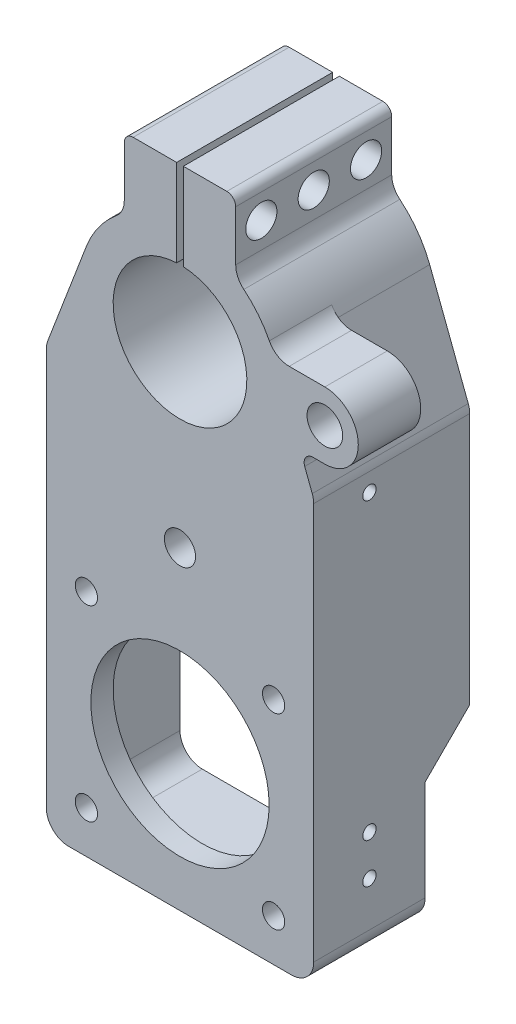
ISO-10303-21;
HEADER;
FILE_DESCRIPTION(('STEP AP214'),'2;1');
FILE_NAME('part.step','',(''),(''),'','','');
FILE_SCHEMA(('AUTOMOTIVE_DESIGN { 1 0 10303 214 1 1 1 1 }'));
ENDSEC;
DATA;
#1=APPLICATION_CONTEXT('core data for automotive mechanical design processes');
#2=APPLICATION_PROTOCOL_DEFINITION('international standard','automotive_design',2000,#1);
#3=PRODUCT_CONTEXT('',#1,'mechanical');
#4=PRODUCT('Part','Part','',(#3));
#5=PRODUCT_RELATED_PRODUCT_CATEGORY('part','',(#4));
#6=PRODUCT_DEFINITION_FORMATION('','',#4);
#7=PRODUCT_DEFINITION_CONTEXT('part definition',#1,'design');
#8=PRODUCT_DEFINITION('design','',#6,#7);
#9=PRODUCT_DEFINITION_SHAPE('','',#8);
#10=(LENGTH_UNIT() NAMED_UNIT(*) SI_UNIT(.MILLI.,.METRE.));
#11=(NAMED_UNIT(*) PLANE_ANGLE_UNIT() SI_UNIT($,.RADIAN.));
#12=(NAMED_UNIT(*) SI_UNIT($,.STERADIAN.) SOLID_ANGLE_UNIT());
#13=UNCERTAINTY_MEASURE_WITH_UNIT(LENGTH_MEASURE(1.E-05),#10,'distance_accuracy_value','');
#14=(GEOMETRIC_REPRESENTATION_CONTEXT(3) GLOBAL_UNCERTAINTY_ASSIGNED_CONTEXT((#13)) GLOBAL_UNIT_ASSIGNED_CONTEXT((#10,
#11,#12)) REPRESENTATION_CONTEXT('',''));
#15=CARTESIAN_POINT('',(0.,0.,0.));
#16=DIRECTION('',(0.,0.,1.));
#17=DIRECTION('',(1.,0.,0.));
#18=AXIS2_PLACEMENT_3D('',#15,#16,#17);
#19=CARTESIAN_POINT('',(0.,229.,28.));
#20=DIRECTION('',(0.,1.,0.));
#21=DIRECTION('',(0.,0.,1.));
#22=AXIS2_PLACEMENT_3D('',#19,#20,#21);
#23=PLANE('',#22);
#24=DIRECTION('',(0.,0.,1.));
#25=VECTOR('',#24,1.);
#26=CARTESIAN_POINT('',(-1.50000000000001,229.,-48.6187156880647));
#27=LINE('',#26,#25);
#28=CARTESIAN_POINT('',(-1.50000000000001,229.,-42.));
#29=VERTEX_POINT('',#28);
#30=CARTESIAN_POINT('',(-1.5,229.,28.));
#31=VERTEX_POINT('',#30);
#32=EDGE_CURVE('E773',#29,#31,#27,.T.);
#33=ORIENTED_EDGE('',*,*,#32,.F.);
#34=DIRECTION('',(1.,0.,0.));
#35=VECTOR('',#34,1.);
#36=CARTESIAN_POINT('',(-21.016696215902,229.,-42.));
#37=LINE('',#36,#35);
#38=CARTESIAN_POINT('',(-21.016696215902,229.,-42.));
#39=VERTEX_POINT('',#38);
#40=EDGE_CURVE('E449',#39,#29,#37,.T.);
#41=ORIENTED_EDGE('',*,*,#40,.F.);
#42=DIRECTION('',(0.,0.,-1.));
#43=VECTOR('',#42,1.);
#44=CARTESIAN_POINT('',(-21.016696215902,229.,28.));
#45=LINE('',#44,#43);
#46=CARTESIAN_POINT('',(-21.016696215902,229.,28.));
#47=VERTEX_POINT('',#46);
#48=EDGE_CURVE('E609',#47,#39,#45,.T.);
#49=ORIENTED_EDGE('',*,*,#48,.F.);
#50=DIRECTION('',(1.,0.,0.));
#51=VECTOR('',#50,1.);
#52=CARTESIAN_POINT('',(0.,229.,28.));
#53=LINE('',#52,#51);
#54=EDGE_CURVE('E504',#47,#31,#53,.T.);
#55=ORIENTED_EDGE('',*,*,#54,.T.);
#56=EDGE_LOOP('',(#33,#41,#49,#55));
#57=FACE_BOUND('',#56,.T.);
#58=ADVANCED_FACE('F38',(#57),#23,.T.);
#59=CARTESIAN_POINT('',(0.,0.,0.));
#60=DIRECTION('',(0.,0.,1.));
#61=DIRECTION('',(1.,0.,0.));
#62=AXIS2_PLACEMENT_3D('',#59,#60,#61);
#63=PLANE('',#62);
#64=CARTESIAN_POINT('',(65.,160.,0.));
#65=DIRECTION('',(0.,0.,1.));
#66=DIRECTION('',(1.,0.,0.));
#67=AXIS2_PLACEMENT_3D('',#64,#65,#66);
#68=CIRCLE('',#67,8.00000000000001);
#69=CARTESIAN_POINT('',(73.,160.,0.));
#70=VERTEX_POINT('',#69);
#71=EDGE_CURVE('E482',#70,#70,#68,.T.);
#72=ORIENTED_EDGE('',*,*,#71,.T.);
#73=EDGE_LOOP('',(#72));
#74=FACE_BOUND('',#73,.T.);
#75=CARTESIAN_POINT('',(0.,160.,0.));
#76=DIRECTION('',(0.,0.,1.));
#77=DIRECTION('',(1.,0.,0.));
#78=AXIS2_PLACEMENT_3D('',#75,#76,#77);
#79=CIRCLE('',#78,45.);
#80=CARTESIAN_POINT('',(40.0825594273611,180.454545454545,0.));
#81=VERTEX_POINT('',#80);
#82=CARTESIAN_POINT('',(42.0413078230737,176.047692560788,0.));
#83=VERTEX_POINT('',#82);
#84=EDGE_CURVE('E632',#81,#83,#79,.F.);
#85=ORIENTED_EDGE('',*,*,#84,.F.);
#86=CARTESIAN_POINT('',(48.9897948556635,185.,0.));
#87=DIRECTION('',(0.,0.,1.));
#88=DIRECTION('',(1.,0.,0.));
#89=AXIS2_PLACEMENT_3D('',#86,#87,#88);
#90=CIRCLE('',#89,10.);
#91=CARTESIAN_POINT('',(48.9897948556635,175.,0.));
#92=VERTEX_POINT('',#91);
#93=EDGE_CURVE('E574',#81,#92,#90,.T.);
#94=ORIENTED_EDGE('',*,*,#93,.T.);
#95=DIRECTION('',(-1.,0.,0.));
#96=VECTOR('',#95,1.);
#97=CARTESIAN_POINT('',(0.,175.,0.));
#98=LINE('',#97,#96);
#99=CARTESIAN_POINT('',(65.,175.,0.));
#100=VERTEX_POINT('',#99);
#101=EDGE_CURVE('E571',#100,#92,#98,.T.);
#102=ORIENTED_EDGE('',*,*,#101,.F.);
#103=CARTESIAN_POINT('',(65.,160.,0.));
#104=DIRECTION('',(0.,0.,1.));
#105=DIRECTION('',(1.,0.,0.));
#106=AXIS2_PLACEMENT_3D('',#103,#104,#105);
#107=CIRCLE('',#106,15.);
#108=CARTESIAN_POINT('',(65.,145.,0.));
#109=VERTEX_POINT('',#108);
#110=EDGE_CURVE('E569',#109,#100,#107,.T.);
#111=ORIENTED_EDGE('',*,*,#110,.F.);
#112=DIRECTION('',(-1.,0.,0.));
#113=VECTOR('',#112,1.);
#114=CARTESIAN_POINT('',(0.,145.,0.));
#115=LINE('',#114,#113);
#116=CARTESIAN_POINT('',(59.6767090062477,145.,0.));
#117=VERTEX_POINT('',#116);
#118=EDGE_CURVE('E566',#109,#117,#115,.T.);
#119=ORIENTED_EDGE('',*,*,#118,.T.);
#120=CARTESIAN_POINT('',(59.6767090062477,141.016696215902,0.));
#121=DIRECTION('',(0.,0.,1.));
#122=DIRECTION('',(1.,0.,0.));
#123=AXIS2_PLACEMENT_3D('',#120,#121,#122);
#124=CIRCLE('',#123,3.98330378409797);
#125=CARTESIAN_POINT('',(55.9553023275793,139.596188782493,0.));
#126=VERTEX_POINT('',#125);
#127=EDGE_CURVE('E477',#117,#126,#124,.T.);
#128=ORIENTED_EDGE('',*,*,#127,.T.);
#129=DIRECTION('',(0.356615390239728,-0.934251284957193,0.));
#130=VECTOR('',#129,1.);
#131=CARTESIAN_POINT('',(59.3425128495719,130.722466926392,0.));
#132=LINE('',#131,#130);
#133=EDGE_CURVE('E427',#83,#126,#132,.T.);
#134=ORIENTED_EDGE('',*,*,#133,.F.);
#135=EDGE_LOOP('',(#85,#94,#102,#111,#119,#128,#134));
#136=FACE_BOUND('',#135,.T.);
#137=ADVANCED_FACE('F948',(#74,#136),#63,.F.);
#138=CARTESIAN_POINT('',(59.6767090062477,141.016696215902,28.));
#139=DIRECTION('',(0.,0.,-1.));
#140=DIRECTION('',(-1.,0.,0.));
#141=AXIS2_PLACEMENT_3D('',#138,#139,#140);
#142=CYLINDRICAL_SURFACE('',#141,3.98330378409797);
#143=ORIENTED_EDGE('',*,*,#127,.F.);
#144=DIRECTION('',(0.,0.,-1.));
#145=VECTOR('',#144,1.);
#146=CARTESIAN_POINT('',(59.6767090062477,145.,28.));
#147=LINE('',#146,#145);
#148=CARTESIAN_POINT('',(59.6767090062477,145.,28.));
#149=VERTEX_POINT('',#148);
#150=EDGE_CURVE('E630',#149,#117,#147,.T.);
#151=ORIENTED_EDGE('',*,*,#150,.F.);
#152=CARTESIAN_POINT('',(59.6767090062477,141.016696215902,28.));
#153=DIRECTION('',(0.,0.,1.));
#154=DIRECTION('',(1.,0.,0.));
#155=AXIS2_PLACEMENT_3D('',#152,#153,#154);
#156=CIRCLE('',#155,3.98330378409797);
#157=CARTESIAN_POINT('',(55.9553023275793,139.596188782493,28.));
#158=VERTEX_POINT('',#157);
#159=EDGE_CURVE('E478',#149,#158,#156,.T.);
#160=ORIENTED_EDGE('',*,*,#159,.T.);
#161=DIRECTION('',(0.,0.,-1.));
#162=VECTOR('',#161,1.);
#163=CARTESIAN_POINT('',(55.9553023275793,139.596188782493,28.));
#164=LINE('',#163,#162);
#165=EDGE_CURVE('E563',#158,#126,#164,.T.);
#166=ORIENTED_EDGE('',*,*,#165,.T.);
#167=EDGE_LOOP('',(#143,#151,#160,#166));
#168=FACE_BOUND('',#167,.T.);
#169=ADVANCED_FACE('F40',(#168),#142,.F.);
#170=CARTESIAN_POINT('',(0.,145.,28.));
#171=DIRECTION('',(0.,-1.,0.));
#172=DIRECTION('',(0.,0.,-1.));
#173=AXIS2_PLACEMENT_3D('',#170,#171,#172);
#174=PLANE('',#173);
#175=ORIENTED_EDGE('',*,*,#118,.F.);
#176=DIRECTION('',(0.,0.,-1.));
#177=VECTOR('',#176,1.);
#178=CARTESIAN_POINT('',(65.,145.,28.));
#179=LINE('',#178,#177);
#180=CARTESIAN_POINT('',(65.,145.,28.));
#181=VERTEX_POINT('',#180);
#182=EDGE_CURVE('E628',#181,#109,#179,.T.);
#183=ORIENTED_EDGE('',*,*,#182,.F.);
#184=DIRECTION('',(-1.,0.,0.));
#185=VECTOR('',#184,1.);
#186=CARTESIAN_POINT('',(0.,145.,28.));
#187=LINE('',#186,#185);
#188=EDGE_CURVE('E481',#181,#149,#187,.T.);
#189=ORIENTED_EDGE('',*,*,#188,.T.);
#190=ORIENTED_EDGE('',*,*,#150,.T.);
#191=EDGE_LOOP('',(#175,#183,#189,#190));
#192=FACE_BOUND('',#191,.T.);
#193=ADVANCED_FACE('F933',(#192),#174,.T.);
#194=CARTESIAN_POINT('',(65.,160.,28.));
#195=DIRECTION('',(0.,0.,-1.));
#196=DIRECTION('',(-1.,0.,0.));
#197=AXIS2_PLACEMENT_3D('',#194,#195,#196);
#198=CYLINDRICAL_SURFACE('',#197,15.);
#199=ORIENTED_EDGE('',*,*,#110,.T.);
#200=DIRECTION('',(0.,0.,-1.));
#201=VECTOR('',#200,1.);
#202=CARTESIAN_POINT('',(65.,175.,28.));
#203=LINE('',#202,#201);
#204=CARTESIAN_POINT('',(65.,175.,28.));
#205=VERTEX_POINT('',#204);
#206=EDGE_CURVE('E625',#205,#100,#203,.T.);
#207=ORIENTED_EDGE('',*,*,#206,.F.);
#208=CARTESIAN_POINT('',(65.,160.,28.));
#209=DIRECTION('',(0.,0.,1.));
#210=DIRECTION('',(1.,0.,0.));
#211=AXIS2_PLACEMENT_3D('',#208,#209,#210);
#212=CIRCLE('',#211,15.);
#213=EDGE_CURVE('E485',#181,#205,#212,.T.);
#214=ORIENTED_EDGE('',*,*,#213,.F.);
#215=ORIENTED_EDGE('',*,*,#182,.T.);
#216=EDGE_LOOP('',(#199,#207,#214,#215));
#217=FACE_BOUND('',#216,.T.);
#218=ADVANCED_FACE('F939',(#217),#198,.T.);
#219=CARTESIAN_POINT('',(0.,175.,28.));
#220=DIRECTION('',(0.,-1.,0.));
#221=DIRECTION('',(0.,0.,-1.));
#222=AXIS2_PLACEMENT_3D('',#219,#220,#221);
#223=PLANE('',#222);
#224=ORIENTED_EDGE('',*,*,#101,.T.);
#225=DIRECTION('',(0.,0.,-1.));
#226=VECTOR('',#225,1.);
#227=CARTESIAN_POINT('',(48.9897948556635,175.,28.));
#228=LINE('',#227,#226);
#229=CARTESIAN_POINT('',(48.9897948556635,175.,28.));
#230=VERTEX_POINT('',#229);
#231=EDGE_CURVE('E623',#230,#92,#228,.T.);
#232=ORIENTED_EDGE('',*,*,#231,.F.);
#233=DIRECTION('',(-1.,0.,0.));
#234=VECTOR('',#233,1.);
#235=CARTESIAN_POINT('',(0.,175.,28.));
#236=LINE('',#235,#234);
#237=EDGE_CURVE('E487',#205,#230,#236,.T.);
#238=ORIENTED_EDGE('',*,*,#237,.F.);
#239=ORIENTED_EDGE('',*,*,#206,.T.);
#240=EDGE_LOOP('',(#224,#232,#238,#239));
#241=FACE_BOUND('',#240,.T.);
#242=ADVANCED_FACE('F943',(#241),#223,.F.);
#243=CARTESIAN_POINT('',(48.9897948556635,185.,28.));
#244=DIRECTION('',(0.,0.,-1.));
#245=DIRECTION('',(-1.,0.,0.));
#246=AXIS2_PLACEMENT_3D('',#243,#244,#245);
#247=CYLINDRICAL_SURFACE('',#246,10.);
#248=ORIENTED_EDGE('',*,*,#93,.F.);
#249=DIRECTION('',(0.,0.,-1.));
#250=VECTOR('',#249,1.);
#251=CARTESIAN_POINT('',(40.0825594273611,180.454545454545,28.));
#252=LINE('',#251,#250);
#253=CARTESIAN_POINT('',(40.0825594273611,180.454545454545,28.));
#254=VERTEX_POINT('',#253);
#255=EDGE_CURVE('E620',#254,#81,#252,.T.);
#256=ORIENTED_EDGE('',*,*,#255,.F.);
#257=CARTESIAN_POINT('',(48.9897948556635,185.,28.));
#258=DIRECTION('',(0.,0.,1.));
#259=DIRECTION('',(1.,0.,0.));
#260=AXIS2_PLACEMENT_3D('',#257,#258,#259);
#261=CIRCLE('',#260,10.);
#262=EDGE_CURVE('E489',#254,#230,#261,.T.);
#263=ORIENTED_EDGE('',*,*,#262,.T.);
#264=ORIENTED_EDGE('',*,*,#231,.T.);
#265=EDGE_LOOP('',(#248,#256,#263,#264));
#266=FACE_BOUND('',#265,.T.);
#267=ADVANCED_FACE('F946',(#266),#247,.F.);
#268=CARTESIAN_POINT('',(0.,160.,28.));
#269=DIRECTION('',(0.,0.,-1.));
#270=DIRECTION('',(-1.,0.,0.));
#271=AXIS2_PLACEMENT_3D('',#268,#269,#270);
#272=CYLINDRICAL_SURFACE('',#271,45.);
#273=ORIENTED_EDGE('',*,*,#255,.T.);
#274=ORIENTED_EDGE('',*,*,#84,.T.);
#275=DIRECTION('',(0.,0.,1.));
#276=VECTOR('',#275,1.);
#277=CARTESIAN_POINT('',(42.0413078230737,176.047692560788,-42.));
#278=LINE('',#277,#276);
#279=CARTESIAN_POINT('',(42.0413078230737,176.047692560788,-42.));
#280=VERTEX_POINT('',#279);
#281=EDGE_CURVE('E472',#280,#83,#278,.T.);
#282=ORIENTED_EDGE('',*,*,#281,.F.);
#283=CARTESIAN_POINT('',(0.,160.,-42.));
#284=DIRECTION('',(0.,0.,-1.));
#285=DIRECTION('',(1.,0.,0.));
#286=AXIS2_PLACEMENT_3D('',#283,#284,#285);
#287=CIRCLE('',#286,45.);
#288=CARTESIAN_POINT('',(28.6363636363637,194.712514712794,-42.));
#289=VERTEX_POINT('',#288);
#290=EDGE_CURVE('E461',#289,#280,#287,.T.);
#291=ORIENTED_EDGE('',*,*,#290,.F.);
#292=DIRECTION('',(0.,0.,-1.));
#293=VECTOR('',#292,1.);
#294=CARTESIAN_POINT('',(28.6363636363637,194.712514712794,28.));
#295=LINE('',#294,#293);
#296=CARTESIAN_POINT('',(28.6363636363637,194.712514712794,28.));
#297=VERTEX_POINT('',#296);
#298=EDGE_CURVE('E618',#297,#289,#295,.T.);
#299=ORIENTED_EDGE('',*,*,#298,.F.);
#300=CARTESIAN_POINT('',(0.,160.,28.));
#301=DIRECTION('',(0.,0.,1.));
#302=DIRECTION('',(1.,0.,0.));
#303=AXIS2_PLACEMENT_3D('',#300,#301,#302);
#304=CIRCLE('',#303,45.);
#305=EDGE_CURVE('E492',#254,#297,#304,.T.);
#306=ORIENTED_EDGE('',*,*,#305,.F.);
#307=EDGE_LOOP('',(#273,#274,#282,#291,#299,#306));
#308=FACE_BOUND('',#307,.T.);
#309=ADVANCED_FACE('F917',(#308),#272,.T.);
#310=CARTESIAN_POINT('',(35.0000000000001,202.426406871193,28.));
#311=DIRECTION('',(0.,0.,-1.));
#312=DIRECTION('',(-1.,0.,0.));
#313=AXIS2_PLACEMENT_3D('',#310,#311,#312);
#314=CYLINDRICAL_SURFACE('',#313,10.);
#315=ORIENTED_EDGE('',*,*,#298,.T.);
#316=CARTESIAN_POINT('',(35.0000000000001,202.426406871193,-42.));
#317=DIRECTION('',(0.,0.,1.));
#318=DIRECTION('',(-1.,0.,0.));
#319=AXIS2_PLACEMENT_3D('',#316,#317,#318);
#320=CIRCLE('',#319,10.);
#321=CARTESIAN_POINT('',(25.0000000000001,202.426406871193,-42.));
#322=VERTEX_POINT('',#321);
#323=EDGE_CURVE('E458',#322,#289,#320,.T.);
#324=ORIENTED_EDGE('',*,*,#323,.F.);
#325=DIRECTION('',(0.,0.,-1.));
#326=VECTOR('',#325,1.);
#327=CARTESIAN_POINT('',(25.0000000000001,202.426406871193,28.));
#328=LINE('',#327,#326);
#329=CARTESIAN_POINT('',(25.0000000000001,202.426406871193,28.));
#330=VERTEX_POINT('',#329);
#331=EDGE_CURVE('E616',#330,#322,#328,.T.);
#332=ORIENTED_EDGE('',*,*,#331,.F.);
#333=CARTESIAN_POINT('',(35.0000000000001,202.426406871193,28.));
#334=DIRECTION('',(0.,0.,1.));
#335=DIRECTION('',(1.,0.,0.));
#336=AXIS2_PLACEMENT_3D('',#333,#334,#335);
#337=CIRCLE('',#336,10.);
#338=EDGE_CURVE('E494',#330,#297,#337,.T.);
#339=ORIENTED_EDGE('',*,*,#338,.T.);
#340=EDGE_LOOP('',(#315,#324,#332,#339));
#341=FACE_BOUND('',#340,.T.);
#342=ADVANCED_FACE('F911',(#341),#314,.F.);
#343=CARTESIAN_POINT('',(25.0000000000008,0.,28.));
#344=DIRECTION('',(1.,0.,0.));
#345=DIRECTION('',(0.,1.,0.));
#346=AXIS2_PLACEMENT_3D('',#343,#344,#345);
#347=PLANE('',#346);
#348=CARTESIAN_POINT('',(25.0000000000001,214.,-30.5));
#349=DIRECTION('',(1.,0.,0.));
#350=DIRECTION('',(0.,1.,0.));
#351=AXIS2_PLACEMENT_3D('',#348,#349,#350);
#352=CIRCLE('',#351,7.);
#353=CARTESIAN_POINT('',(25.,221.,-30.5));
#354=VERTEX_POINT('',#353);
#355=EDGE_CURVE('E762',#354,#354,#352,.T.);
#356=ORIENTED_EDGE('',*,*,#355,.F.);
#357=EDGE_LOOP('',(#356));
#358=FACE_BOUND('',#357,.T.);
#359=CARTESIAN_POINT('',(25.0000000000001,214.,16.5));
#360=DIRECTION('',(1.,0.,0.));
#361=DIRECTION('',(0.,1.,0.));
#362=AXIS2_PLACEMENT_3D('',#359,#360,#361);
#363=CIRCLE('',#362,7.);
#364=CARTESIAN_POINT('',(25.,221.,16.5));
#365=VERTEX_POINT('',#364);
#366=EDGE_CURVE('E757',#365,#365,#363,.T.);
#367=ORIENTED_EDGE('',*,*,#366,.F.);
#368=EDGE_LOOP('',(#367));
#369=FACE_BOUND('',#368,.T.);
#370=CARTESIAN_POINT('',(25.0000000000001,214.,-7.));
#371=DIRECTION('',(1.,0.,0.));
#372=DIRECTION('',(0.,1.,0.));
#373=AXIS2_PLACEMENT_3D('',#370,#371,#372);
#374=CIRCLE('',#373,7.);
#375=CARTESIAN_POINT('',(25.,221.,-7.));
#376=VERTEX_POINT('',#375);
#377=EDGE_CURVE('E761',#376,#376,#374,.T.);
#378=ORIENTED_EDGE('',*,*,#377,.F.);
#379=EDGE_LOOP('',(#378));
#380=FACE_BOUND('',#379,.T.);
#381=ORIENTED_EDGE('',*,*,#331,.T.);
#382=DIRECTION('',(0.,-1.,0.));
#383=VECTOR('',#382,1.);
#384=CARTESIAN_POINT('',(25.,225.016696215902,-42.));
#385=LINE('',#384,#383);
#386=CARTESIAN_POINT('',(25.,225.016696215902,-42.));
#387=VERTEX_POINT('',#386);
#388=EDGE_CURVE('E455',#387,#322,#385,.T.);
#389=ORIENTED_EDGE('',*,*,#388,.F.);
#390=DIRECTION('',(0.,0.,-1.));
#391=VECTOR('',#390,1.);
#392=CARTESIAN_POINT('',(25.,225.016696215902,28.));
#393=LINE('',#392,#391);
#394=CARTESIAN_POINT('',(25.,225.016696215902,28.));
#395=VERTEX_POINT('',#394);
#396=EDGE_CURVE('E614',#395,#387,#393,.T.);
#397=ORIENTED_EDGE('',*,*,#396,.F.);
#398=DIRECTION('',(0.,-1.,0.));
#399=VECTOR('',#398,1.);
#400=CARTESIAN_POINT('',(25.0000000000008,0.,28.));
#401=LINE('',#400,#399);
#402=EDGE_CURVE('E497',#395,#330,#401,.T.);
#403=ORIENTED_EDGE('',*,*,#402,.T.);
#404=EDGE_LOOP('',(#381,#389,#397,#403));
#405=FACE_BOUND('',#404,.T.);
#406=ADVANCED_FACE('F908',(#358,#369,#380,#405),#347,.T.);
#407=CARTESIAN_POINT('',(21.016696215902,225.016696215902,28.));
#408=DIRECTION('',(0.,0.,-1.));
#409=DIRECTION('',(-1.,0.,0.));
#410=AXIS2_PLACEMENT_3D('',#407,#408,#409);
#411=CYLINDRICAL_SURFACE('',#410,3.98330378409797);
#412=ORIENTED_EDGE('',*,*,#396,.T.);
#413=CARTESIAN_POINT('',(21.016696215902,225.016696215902,-42.));
#414=DIRECTION('',(0.,0.,-1.));
#415=DIRECTION('',(-1.,0.,0.));
#416=AXIS2_PLACEMENT_3D('',#413,#414,#415);
#417=CIRCLE('',#416,3.98330378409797);
#418=CARTESIAN_POINT('',(21.016696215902,229.,-42.));
#419=VERTEX_POINT('',#418);
#420=EDGE_CURVE('E452',#419,#387,#417,.T.);
#421=ORIENTED_EDGE('',*,*,#420,.F.);
#422=DIRECTION('',(0.,0.,-1.));
#423=VECTOR('',#422,1.);
#424=CARTESIAN_POINT('',(21.016696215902,229.,28.));
#425=LINE('',#424,#423);
#426=CARTESIAN_POINT('',(21.016696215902,229.,28.));
#427=VERTEX_POINT('',#426);
#428=EDGE_CURVE('E611',#427,#419,#425,.T.);
#429=ORIENTED_EDGE('',*,*,#428,.F.);
#430=CARTESIAN_POINT('',(21.016696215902,225.016696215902,28.));
#431=DIRECTION('',(0.,0.,1.));
#432=DIRECTION('',(1.,0.,0.));
#433=AXIS2_PLACEMENT_3D('',#430,#431,#432);
#434=CIRCLE('',#433,3.98330378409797);
#435=EDGE_CURVE('E500',#427,#395,#434,.F.);
#436=ORIENTED_EDGE('',*,*,#435,.T.);
#437=EDGE_LOOP('',(#412,#421,#429,#436));
#438=FACE_BOUND('',#437,.T.);
#439=ADVANCED_FACE('F904',(#438),#411,.T.);
#440=DIRECTION('',(0.,0.,-1.));
#441=VECTOR('',#440,1.);
#442=CARTESIAN_POINT('',(1.49999999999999,229.,-48.6187156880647));
#443=LINE('',#442,#441);
#444=CARTESIAN_POINT('',(1.5,229.,28.));
#445=VERTEX_POINT('',#444);
#446=CARTESIAN_POINT('',(1.5,229.,-42.));
#447=VERTEX_POINT('',#446);
#448=EDGE_CURVE('E777',#445,#447,#443,.T.);
#449=ORIENTED_EDGE('',*,*,#448,.F.);
#450=EDGE_CURVE('E503',#445,#427,#53,.T.);
#451=ORIENTED_EDGE('',*,*,#450,.T.);
#452=ORIENTED_EDGE('',*,*,#428,.T.);
#453=EDGE_CURVE('E448',#447,#419,#37,.T.);
#454=ORIENTED_EDGE('',*,*,#453,.F.);
#455=EDGE_LOOP('',(#449,#451,#452,#454));
#456=FACE_BOUND('',#455,.T.);
#457=ADVANCED_FACE('F900',(#456),#23,.T.);
#458=CARTESIAN_POINT('',(-21.016696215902,225.016696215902,28.));
#459=DIRECTION('',(0.,0.,-1.));
#460=DIRECTION('',(-1.,0.,0.));
#461=AXIS2_PLACEMENT_3D('',#458,#459,#460);
#462=CYLINDRICAL_SURFACE('',#461,3.98330378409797);
#463=ORIENTED_EDGE('',*,*,#48,.T.);
#464=CARTESIAN_POINT('',(-21.016696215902,225.016696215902,-42.));
#465=DIRECTION('',(0.,0.,-1.));
#466=DIRECTION('',(-1.,0.,0.));
#467=AXIS2_PLACEMENT_3D('',#464,#465,#466);
#468=CIRCLE('',#467,3.98330378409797);
#469=CARTESIAN_POINT('',(-25.,225.016696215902,-42.));
#470=VERTEX_POINT('',#469);
#471=EDGE_CURVE('E445',#470,#39,#468,.T.);
#472=ORIENTED_EDGE('',*,*,#471,.F.);
#473=DIRECTION('',(0.,0.,-1.));
#474=VECTOR('',#473,1.);
#475=CARTESIAN_POINT('',(-25.,225.016696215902,28.));
#476=LINE('',#475,#474);
#477=CARTESIAN_POINT('',(-25.,225.016696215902,28.));
#478=VERTEX_POINT('',#477);
#479=EDGE_CURVE('E607',#478,#470,#476,.T.);
#480=ORIENTED_EDGE('',*,*,#479,.F.);
#481=CARTESIAN_POINT('',(-21.016696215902,225.016696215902,28.));
#482=DIRECTION('',(0.,0.,1.));
#483=DIRECTION('',(1.,0.,0.));
#484=AXIS2_PLACEMENT_3D('',#481,#482,#483);
#485=CIRCLE('',#484,3.98330378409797);
#486=EDGE_CURVE('E507',#47,#478,#485,.T.);
#487=ORIENTED_EDGE('',*,*,#486,.F.);
#488=EDGE_LOOP('',(#463,#472,#480,#487));
#489=FACE_BOUND('',#488,.T.);
#490=ADVANCED_FACE('F877',(#489),#462,.T.);
#491=CARTESIAN_POINT('',(-24.9999999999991,0.,28.));
#492=DIRECTION('',(1.,0.,0.));
#493=DIRECTION('',(0.,1.,0.));
#494=AXIS2_PLACEMENT_3D('',#491,#492,#493);
#495=PLANE('',#494);
#496=CARTESIAN_POINT('',(-24.9999999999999,214.,-7.));
#497=DIRECTION('',(1.,0.,0.));
#498=DIRECTION('',(0.,1.,0.));
#499=AXIS2_PLACEMENT_3D('',#496,#497,#498);
#500=CIRCLE('',#499,4.5);
#501=CARTESIAN_POINT('',(-25.,218.5,-7.));
#502=VERTEX_POINT('',#501);
#503=EDGE_CURVE('E725',#502,#502,#500,.F.);
#504=ORIENTED_EDGE('',*,*,#503,.F.);
#505=EDGE_LOOP('',(#504));
#506=FACE_BOUND('',#505,.T.);
#507=CARTESIAN_POINT('',(-24.9999999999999,214.,-30.5));
#508=DIRECTION('',(1.,0.,0.));
#509=DIRECTION('',(0.,1.,0.));
#510=AXIS2_PLACEMENT_3D('',#507,#508,#509);
#511=CIRCLE('',#510,4.5);
#512=CARTESIAN_POINT('',(-25.,218.5,-30.5));
#513=VERTEX_POINT('',#512);
#514=EDGE_CURVE('E726',#513,#513,#511,.F.);
#515=ORIENTED_EDGE('',*,*,#514,.F.);
#516=EDGE_LOOP('',(#515));
#517=FACE_BOUND('',#516,.T.);
#518=CARTESIAN_POINT('',(-24.9999999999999,214.,16.5));
#519=DIRECTION('',(1.,0.,0.));
#520=DIRECTION('',(0.,1.,0.));
#521=AXIS2_PLACEMENT_3D('',#518,#519,#520);
#522=CIRCLE('',#521,4.5);
#523=CARTESIAN_POINT('',(-25.,218.5,16.5));
#524=VERTEX_POINT('',#523);
#525=EDGE_CURVE('E748',#524,#524,#522,.F.);
#526=ORIENTED_EDGE('',*,*,#525,.F.);
#527=EDGE_LOOP('',(#526));
#528=FACE_BOUND('',#527,.T.);
#529=ORIENTED_EDGE('',*,*,#479,.T.);
#530=DIRECTION('',(0.,1.,0.));
#531=VECTOR('',#530,1.);
#532=CARTESIAN_POINT('',(-25.,225.016696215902,-42.));
#533=LINE('',#532,#531);
#534=CARTESIAN_POINT('',(-24.9999999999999,202.426406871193,-42.));
#535=VERTEX_POINT('',#534);
#536=EDGE_CURVE('E442',#535,#470,#533,.T.);
#537=ORIENTED_EDGE('',*,*,#536,.F.);
#538=DIRECTION('',(0.,0.,-1.));
#539=VECTOR('',#538,1.);
#540=CARTESIAN_POINT('',(-24.9999999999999,202.426406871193,28.));
#541=LINE('',#540,#539);
#542=CARTESIAN_POINT('',(-24.9999999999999,202.426406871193,28.));
#543=VERTEX_POINT('',#542);
#544=EDGE_CURVE('E605',#543,#535,#541,.T.);
#545=ORIENTED_EDGE('',*,*,#544,.F.);
#546=DIRECTION('',(0.,-1.,0.));
#547=VECTOR('',#546,1.);
#548=CARTESIAN_POINT('',(-24.9999999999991,0.,28.));
#549=LINE('',#548,#547);
#550=EDGE_CURVE('E509',#478,#543,#549,.T.);
#551=ORIENTED_EDGE('',*,*,#550,.F.);
#552=EDGE_LOOP('',(#529,#537,#545,#551));
#553=FACE_BOUND('',#552,.T.);
#554=ADVANCED_FACE('F872',(#506,#517,#528,#553),#495,.F.);
#555=CARTESIAN_POINT('',(-34.9999999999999,202.426406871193,28.));
#556=DIRECTION('',(0.,0.,-1.));
#557=DIRECTION('',(-1.,0.,0.));
#558=AXIS2_PLACEMENT_3D('',#555,#556,#557);
#559=CYLINDRICAL_SURFACE('',#558,10.);
#560=ORIENTED_EDGE('',*,*,#544,.T.);
#561=CARTESIAN_POINT('',(-34.9999999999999,202.426406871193,-42.));
#562=DIRECTION('',(0.,0.,1.));
#563=DIRECTION('',(-1.,0.,0.));
#564=AXIS2_PLACEMENT_3D('',#561,#562,#563);
#565=CIRCLE('',#564,9.99999999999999);
#566=CARTESIAN_POINT('',(-28.6363636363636,194.712514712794,-42.));
#567=VERTEX_POINT('',#566);
#568=EDGE_CURVE('E439',#567,#535,#565,.T.);
#569=ORIENTED_EDGE('',*,*,#568,.F.);
#570=DIRECTION('',(0.,0.,-1.));
#571=VECTOR('',#570,1.);
#572=CARTESIAN_POINT('',(-28.6363636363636,194.712514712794,28.));
#573=LINE('',#572,#571);
#574=CARTESIAN_POINT('',(-28.6363636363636,194.712514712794,28.));
#575=VERTEX_POINT('',#574);
#576=EDGE_CURVE('E603',#575,#567,#573,.T.);
#577=ORIENTED_EDGE('',*,*,#576,.F.);
#578=CARTESIAN_POINT('',(-34.9999999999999,202.426406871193,28.));
#579=DIRECTION('',(0.,0.,1.));
#580=DIRECTION('',(1.,0.,0.));
#581=AXIS2_PLACEMENT_3D('',#578,#579,#580);
#582=CIRCLE('',#581,10.);
#583=EDGE_CURVE('E511',#543,#575,#582,.F.);
#584=ORIENTED_EDGE('',*,*,#583,.F.);
#585=EDGE_LOOP('',(#560,#569,#577,#584));
#586=FACE_BOUND('',#585,.T.);
#587=ADVANCED_FACE('F867',(#586),#559,.F.);
#588=CARTESIAN_POINT('',(0.,160.,28.));
#589=DIRECTION('',(0.,0.,-1.));
#590=DIRECTION('',(-1.,0.,0.));
#591=AXIS2_PLACEMENT_3D('',#588,#589,#590);
#592=CYLINDRICAL_SURFACE('',#591,45.);
#593=ORIENTED_EDGE('',*,*,#576,.T.);
#594=CARTESIAN_POINT('',(0.,160.,-42.));
#595=DIRECTION('',(0.,0.,-1.));
#596=DIRECTION('',(-1.,0.,0.));
#597=AXIS2_PLACEMENT_3D('',#594,#595,#596);
#598=CIRCLE('',#597,45.);
#599=CARTESIAN_POINT('',(-42.0413078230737,176.047692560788,-42.));
#600=VERTEX_POINT('',#599);
#601=EDGE_CURVE('E436',#600,#567,#598,.T.);
#602=ORIENTED_EDGE('',*,*,#601,.F.);
#603=DIRECTION('',(0.,0.,-1.));
#604=VECTOR('',#603,1.);
#605=CARTESIAN_POINT('',(-42.0413078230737,176.047692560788,28.));
#606=LINE('',#605,#604);
#607=CARTESIAN_POINT('',(-42.0413078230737,176.047692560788,28.));
#608=VERTEX_POINT('',#607);
#609=EDGE_CURVE('E601',#608,#600,#606,.T.);
#610=ORIENTED_EDGE('',*,*,#609,.F.);
#611=CARTESIAN_POINT('',(0.,160.,28.));
#612=DIRECTION('',(0.,0.,1.));
#613=DIRECTION('',(1.,0.,0.));
#614=AXIS2_PLACEMENT_3D('',#611,#612,#613);
#615=CIRCLE('',#614,45.);
#616=EDGE_CURVE('E513',#575,#608,#615,.T.);
#617=ORIENTED_EDGE('',*,*,#616,.F.);
#618=EDGE_LOOP('',(#593,#602,#610,#617));
#619=FACE_BOUND('',#618,.T.);
#620=ADVANCED_FACE('F862',(#619),#592,.T.);
#621=CARTESIAN_POINT('',(-95.34824967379,36.3956184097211,28.));
#622=DIRECTION('',(-0.934251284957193,0.356615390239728,0.));
#623=DIRECTION('',(-0.356615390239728,-0.934251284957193,0.));
#624=AXIS2_PLACEMENT_3D('',#621,#622,#623);
#625=PLANE('',#624);
#626=CARTESIAN_POINT('',(-54.5228464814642,143.348897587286,-1.99999999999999));
#627=DIRECTION('',(-0.934251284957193,0.356615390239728,0.));
#628=DIRECTION('',(-0.356615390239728,-0.934251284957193,0.));
#629=AXIS2_PLACEMENT_3D('',#626,#627,#628);
#630=CIRCLE('',#629,2.50000000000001);
#631=CARTESIAN_POINT('',(-55.4143849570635,141.013269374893,-1.99999999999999));
#632=VERTEX_POINT('',#631);
#633=EDGE_CURVE('E334',#632,#632,#630,.T.);
#634=ORIENTED_EDGE('',*,*,#633,.F.);
#635=EDGE_LOOP('',(#634));
#636=FACE_BOUND('',#635,.T.);
#637=CARTESIAN_POINT('',(-46.6773078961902,163.902425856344,-2.));
#638=DIRECTION('',(-0.934251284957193,0.356615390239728,0.));
#639=DIRECTION('',(-0.356615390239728,-0.934251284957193,0.));
#640=AXIS2_PLACEMENT_3D('',#637,#638,#639);
#641=CIRCLE('',#640,2.5);
#642=CARTESIAN_POINT('',(-47.5688463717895,161.566797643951,-2.));
#643=VERTEX_POINT('',#642);
#644=EDGE_CURVE('E333',#643,#643,#641,.T.);
#645=ORIENTED_EDGE('',*,*,#644,.F.);
#646=EDGE_LOOP('',(#645));
#647=FACE_BOUND('',#646,.T.);
#648=ORIENTED_EDGE('',*,*,#609,.T.);
#649=DIRECTION('',(0.356615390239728,0.934251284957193,0.));
#650=VECTOR('',#649,1.);
#651=CARTESIAN_POINT('',(-59.3425128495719,130.722466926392,-42.));
#652=LINE('',#651,#650);
#653=CARTESIAN_POINT('',(-59.3425128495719,130.722466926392,-42.));
#654=VERTEX_POINT('',#653);
#655=EDGE_CURVE('E433',#654,#600,#652,.T.);
#656=ORIENTED_EDGE('',*,*,#655,.F.);
#657=DIRECTION('',(0.,0.,-1.));
#658=VECTOR('',#657,1.);
#659=CARTESIAN_POINT('',(-59.3425128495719,130.722466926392,28.));
#660=LINE('',#659,#658);
#661=CARTESIAN_POINT('',(-59.3425128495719,130.722466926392,28.));
#662=VERTEX_POINT('',#661);
#663=EDGE_CURVE('E599',#662,#654,#660,.T.);
#664=ORIENTED_EDGE('',*,*,#663,.F.);
#665=DIRECTION('',(0.356615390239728,0.934251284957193,0.));
#666=VECTOR('',#665,1.);
#667=CARTESIAN_POINT('',(-95.34824967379,36.3956184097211,28.));
#668=LINE('',#667,#666);
#669=EDGE_CURVE('E515',#662,#608,#668,.T.);
#670=ORIENTED_EDGE('',*,*,#669,.T.);
#671=EDGE_LOOP('',(#648,#656,#664,#670));
#672=FACE_BOUND('',#671,.T.);
#673=ADVANCED_FACE('F858',(#636,#647,#672),#625,.T.);
#674=CARTESIAN_POINT('',(-50.,127.156313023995,28.));
#675=DIRECTION('',(0.,0.,-1.));
#676=DIRECTION('',(-1.,0.,0.));
#677=AXIS2_PLACEMENT_3D('',#674,#675,#676);
#678=CYLINDRICAL_SURFACE('',#677,10.);
#679=ORIENTED_EDGE('',*,*,#663,.T.);
#680=CARTESIAN_POINT('',(-50.,127.156313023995,-42.));
#681=DIRECTION('',(0.,0.,-1.));
#682=DIRECTION('',(-1.,0.,0.));
#683=AXIS2_PLACEMENT_3D('',#680,#681,#682);
#684=CIRCLE('',#683,10.);
#685=CARTESIAN_POINT('',(-60.,127.156313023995,-42.));
#686=VERTEX_POINT('',#685);
#687=EDGE_CURVE('E430',#686,#654,#684,.T.);
#688=ORIENTED_EDGE('',*,*,#687,.F.);
#689=DIRECTION('',(0.,0.,-1.));
#690=VECTOR('',#689,1.);
#691=CARTESIAN_POINT('',(-60.,127.156313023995,28.));
#692=LINE('',#691,#690);
#693=CARTESIAN_POINT('',(-60.,127.156313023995,28.));
#694=VERTEX_POINT('',#693);
#695=EDGE_CURVE('E596',#694,#686,#692,.T.);
#696=ORIENTED_EDGE('',*,*,#695,.F.);
#697=CARTESIAN_POINT('',(-50.,127.156313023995,28.));
#698=DIRECTION('',(0.,0.,1.));
#699=DIRECTION('',(1.,0.,0.));
#700=AXIS2_PLACEMENT_3D('',#697,#698,#699);
#701=CIRCLE('',#700,10.);
#702=EDGE_CURVE('E518',#662,#694,#701,.T.);
#703=ORIENTED_EDGE('',*,*,#702,.F.);
#704=EDGE_LOOP('',(#679,#688,#696,#703));
#705=FACE_BOUND('',#704,.T.);
#706=ADVANCED_FACE('F854',(#705),#678,.T.);
#707=CARTESIAN_POINT('',(-60.,0.,28.));
#708=DIRECTION('',(-1.,0.,0.));
#709=DIRECTION('',(0.,-1.,0.));
#710=AXIS2_PLACEMENT_3D('',#707,#708,#709);
#711=PLANE('',#710);
#712=DIRECTION('',(0.,-1.,0.));
#713=VECTOR('',#712,1.);
#714=CARTESIAN_POINT('',(-60.,-6.00000000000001,-22.));
#715=LINE('',#714,#713);
#716=CARTESIAN_POINT('',(-60.,-6.00000000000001,-22.));
#717=VERTEX_POINT('',#716);
#718=CARTESIAN_POINT('',(-60.,-51.,-22.));
#719=VERTEX_POINT('',#718);
#720=EDGE_CURVE('E810',#717,#719,#715,.T.);
#721=ORIENTED_EDGE('',*,*,#720,.T.);
#722=DIRECTION('',(0.,0.,-1.));
#723=VECTOR('',#722,1.);
#724=CARTESIAN_POINT('',(-60.,-50.9999999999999,28.));
#725=LINE('',#724,#723);
#726=CARTESIAN_POINT('',(-60.,-50.9999999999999,28.));
#727=VERTEX_POINT('',#726);
#728=EDGE_CURVE('E593',#727,#719,#725,.T.);
#729=ORIENTED_EDGE('',*,*,#728,.F.);
#730=DIRECTION('',(0.,1.,0.));
#731=VECTOR('',#730,1.);
#732=CARTESIAN_POINT('',(-60.,0.,28.));
#733=LINE('',#732,#731);
#734=EDGE_CURVE('E520',#727,#694,#733,.T.);
#735=ORIENTED_EDGE('',*,*,#734,.T.);
#736=ORIENTED_EDGE('',*,*,#695,.T.);
#737=DIRECTION('',(0.,1.,0.));
#738=VECTOR('',#737,1.);
#739=CARTESIAN_POINT('',(-60.,-50.9999999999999,-42.));
#740=LINE('',#739,#738);
#741=CARTESIAN_POINT('',(-60.,14.0000000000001,-42.));
#742=VERTEX_POINT('',#741);
#743=EDGE_CURVE('E428',#742,#686,#740,.T.);
#744=ORIENTED_EDGE('',*,*,#743,.F.);
#745=DIRECTION('',(0.,-0.707106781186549,0.707106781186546));
#746=VECTOR('',#745,1.);
#747=CARTESIAN_POINT('',(-60.,-6.00000000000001,-22.));
#748=LINE('',#747,#746);
#749=EDGE_CURVE('E812',#742,#717,#748,.T.);
#750=ORIENTED_EDGE('',*,*,#749,.T.);
#751=EDGE_LOOP('',(#721,#729,#735,#736,#744,#750));
#752=FACE_BOUND('',#751,.T.);
#753=ADVANCED_FACE('F847',(#752),#711,.T.);
#754=CARTESIAN_POINT('',(-50.,-51.,28.));
#755=DIRECTION('',(0.,0.,-1.));
#756=DIRECTION('',(-1.,0.,0.));
#757=AXIS2_PLACEMENT_3D('',#754,#755,#756);
#758=CYLINDRICAL_SURFACE('',#757,10.);
#759=ORIENTED_EDGE('',*,*,#728,.T.);
#760=CARTESIAN_POINT('',(-50.,-51.,-22.));
#761=DIRECTION('',(0.,0.,1.));
#762=DIRECTION('',(0.,-1.,0.));
#763=AXIS2_PLACEMENT_3D('',#760,#761,#762);
#764=CIRCLE('',#763,10.);
#765=CARTESIAN_POINT('',(-49.9999999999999,-61.,-22.));
#766=VERTEX_POINT('',#765);
#767=EDGE_CURVE('E718',#719,#766,#764,.T.);
#768=ORIENTED_EDGE('',*,*,#767,.T.);
#769=DIRECTION('',(0.,0.,-1.));
#770=VECTOR('',#769,1.);
#771=CARTESIAN_POINT('',(-49.9999999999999,-61.,28.));
#772=LINE('',#771,#770);
#773=CARTESIAN_POINT('',(-49.9999999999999,-61.,28.));
#774=VERTEX_POINT('',#773);
#775=EDGE_CURVE('E590',#774,#766,#772,.T.);
#776=ORIENTED_EDGE('',*,*,#775,.F.);
#777=CARTESIAN_POINT('',(-50.,-51.,28.));
#778=DIRECTION('',(0.,0.,1.));
#779=DIRECTION('',(1.,0.,0.));
#780=AXIS2_PLACEMENT_3D('',#777,#778,#779);
#781=CIRCLE('',#780,10.);
#782=EDGE_CURVE('E523',#727,#774,#781,.T.);
#783=ORIENTED_EDGE('',*,*,#782,.F.);
#784=EDGE_LOOP('',(#759,#768,#776,#783));
#785=FACE_BOUND('',#784,.T.);
#786=ADVANCED_FACE('F846',(#785),#758,.T.);
#787=CARTESIAN_POINT('',(0.,-61.,28.));
#788=DIRECTION('',(0.,-1.,0.));
#789=DIRECTION('',(1.,0.,0.));
#790=AXIS2_PLACEMENT_3D('',#787,#788,#789);
#791=PLANE('',#790);
#792=DIRECTION('',(1.,0.,0.));
#793=VECTOR('',#792,1.);
#794=CARTESIAN_POINT('',(-60.,-61.,-22.));
#795=LINE('',#794,#793);
#796=CARTESIAN_POINT('',(50.,-61.,-22.));
#797=VERTEX_POINT('',#796);
#798=EDGE_CURVE('E699',#766,#797,#795,.T.);
#799=ORIENTED_EDGE('',*,*,#798,.T.);
#800=DIRECTION('',(0.,0.,-1.));
#801=VECTOR('',#800,1.);
#802=CARTESIAN_POINT('',(49.9999999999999,-61.,28.));
#803=LINE('',#802,#801);
#804=CARTESIAN_POINT('',(49.9999999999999,-61.,28.));
#805=VERTEX_POINT('',#804);
#806=EDGE_CURVE('E587',#805,#797,#803,.T.);
#807=ORIENTED_EDGE('',*,*,#806,.F.);
#808=DIRECTION('',(-1.,0.,0.));
#809=VECTOR('',#808,1.);
#810=CARTESIAN_POINT('',(0.,-61.,28.));
#811=LINE('',#810,#809);
#812=EDGE_CURVE('E525',#805,#774,#811,.T.);
#813=ORIENTED_EDGE('',*,*,#812,.T.);
#814=ORIENTED_EDGE('',*,*,#775,.T.);
#815=EDGE_LOOP('',(#799,#807,#813,#814));
#816=FACE_BOUND('',#815,.T.);
#817=ADVANCED_FACE('F844',(#816),#791,.T.);
#818=CARTESIAN_POINT('',(50.,-51.,28.));
#819=DIRECTION('',(0.,0.,-1.));
#820=DIRECTION('',(-1.,0.,0.));
#821=AXIS2_PLACEMENT_3D('',#818,#819,#820);
#822=CYLINDRICAL_SURFACE('',#821,10.);
#823=CARTESIAN_POINT('',(50.,-51.,-22.));
#824=DIRECTION('',(0.,0.,1.));
#825=DIRECTION('',(0.,-1.,0.));
#826=AXIS2_PLACEMENT_3D('',#823,#824,#825);
#827=CIRCLE('',#826,10.);
#828=CARTESIAN_POINT('',(60.,-50.9999999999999,-22.));
#829=VERTEX_POINT('',#828);
#830=EDGE_CURVE('E716',#829,#797,#827,.F.);
#831=ORIENTED_EDGE('',*,*,#830,.F.);
#832=DIRECTION('',(0.,0.,-1.));
#833=VECTOR('',#832,1.);
#834=CARTESIAN_POINT('',(60.,-50.9999999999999,28.));
#835=LINE('',#834,#833);
#836=CARTESIAN_POINT('',(60.,-50.9999999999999,28.));
#837=VERTEX_POINT('',#836);
#838=EDGE_CURVE('E584',#837,#829,#835,.T.);
#839=ORIENTED_EDGE('',*,*,#838,.F.);
#840=CARTESIAN_POINT('',(50.,-51.,28.));
#841=DIRECTION('',(0.,0.,1.));
#842=DIRECTION('',(1.,0.,0.));
#843=AXIS2_PLACEMENT_3D('',#840,#841,#842);
#844=CIRCLE('',#843,10.);
#845=EDGE_CURVE('E528',#837,#805,#844,.F.);
#846=ORIENTED_EDGE('',*,*,#845,.T.);
#847=ORIENTED_EDGE('',*,*,#806,.T.);
#848=EDGE_LOOP('',(#831,#839,#846,#847));
#849=FACE_BOUND('',#848,.T.);
#850=ADVANCED_FACE('F833',(#849),#822,.T.);
#851=CARTESIAN_POINT('',(60.,0.,28.));
#852=DIRECTION('',(1.,0.,0.));
#853=DIRECTION('',(0.,1.,0.));
#854=AXIS2_PLACEMENT_3D('',#851,#852,#853);
#855=PLANE('',#854);
#856=CARTESIAN_POINT('',(60.,-13.,3.));
#857=DIRECTION('',(1.,0.,0.));
#858=DIRECTION('',(0.,1.,0.));
#859=AXIS2_PLACEMENT_3D('',#856,#857,#858);
#860=CIRCLE('',#859,3.);
#861=CARTESIAN_POINT('',(60.,-10.,3.));
#862=VERTEX_POINT('',#861);
#863=EDGE_CURVE('E1681',#862,#862,#860,.T.);
#864=ORIENTED_EDGE('',*,*,#863,.F.);
#865=EDGE_LOOP('',(#864));
#866=FACE_BOUND('',#865,.T.);
#867=CARTESIAN_POINT('',(60.,119.,3.));
#868=DIRECTION('',(1.,0.,0.));
#869=DIRECTION('',(0.,1.,0.));
#870=AXIS2_PLACEMENT_3D('',#867,#868,#869);
#871=CIRCLE('',#870,3.);
#872=CARTESIAN_POINT('',(60.,122.,3.));
#873=VERTEX_POINT('',#872);
#874=EDGE_CURVE('E1674',#873,#873,#871,.T.);
#875=ORIENTED_EDGE('',*,*,#874,.F.);
#876=EDGE_LOOP('',(#875));
#877=FACE_BOUND('',#876,.T.);
#878=CARTESIAN_POINT('',(60.,-31.,3.));
#879=DIRECTION('',(1.,0.,0.));
#880=DIRECTION('',(0.,1.,0.));
#881=AXIS2_PLACEMENT_3D('',#878,#879,#880);
#882=CIRCLE('',#881,3.);
#883=CARTESIAN_POINT('',(60.,-28.,3.));
#884=VERTEX_POINT('',#883);
#885=EDGE_CURVE('E1680',#884,#884,#882,.T.);
#886=ORIENTED_EDGE('',*,*,#885,.F.);
#887=EDGE_LOOP('',(#886));
#888=FACE_BOUND('',#887,.T.);
#889=DIRECTION('',(0.,-1.,0.));
#890=VECTOR('',#889,1.);
#891=CARTESIAN_POINT('',(60.,-6.,-22.));
#892=LINE('',#891,#890);
#893=CARTESIAN_POINT('',(60.,-6.,-22.));
#894=VERTEX_POINT('',#893);
#895=EDGE_CURVE('E817',#894,#829,#892,.T.);
#896=ORIENTED_EDGE('',*,*,#895,.F.);
#897=DIRECTION('',(0.,-0.707106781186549,0.707106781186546));
#898=VECTOR('',#897,1.);
#899=CARTESIAN_POINT('',(60.,-6.,-22.));
#900=LINE('',#899,#898);
#901=CARTESIAN_POINT('',(60.,14.0000000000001,-42.));
#902=VERTEX_POINT('',#901);
#903=EDGE_CURVE('E821',#902,#894,#900,.T.);
#904=ORIENTED_EDGE('',*,*,#903,.F.);
#905=DIRECTION('',(0.,-1.,0.));
#906=VECTOR('',#905,1.);
#907=CARTESIAN_POINT('',(60.,-50.9999999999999,-42.));
#908=LINE('',#907,#906);
#909=CARTESIAN_POINT('',(60.,127.156313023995,-42.));
#910=VERTEX_POINT('',#909);
#911=EDGE_CURVE('E469',#910,#902,#908,.T.);
#912=ORIENTED_EDGE('',*,*,#911,.F.);
#913=DIRECTION('',(0.,0.,-1.));
#914=VECTOR('',#913,1.);
#915=CARTESIAN_POINT('',(60.,127.156313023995,28.));
#916=LINE('',#915,#914);
#917=CARTESIAN_POINT('',(60.,127.156313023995,28.));
#918=VERTEX_POINT('',#917);
#919=EDGE_CURVE('E582',#918,#910,#916,.T.);
#920=ORIENTED_EDGE('',*,*,#919,.F.);
#921=DIRECTION('',(0.,-1.,0.));
#922=VECTOR('',#921,1.);
#923=CARTESIAN_POINT('',(60.,0.,28.));
#924=LINE('',#923,#922);
#925=EDGE_CURVE('E531',#918,#837,#924,.T.);
#926=ORIENTED_EDGE('',*,*,#925,.T.);
#927=ORIENTED_EDGE('',*,*,#838,.T.);
#928=EDGE_LOOP('',(#896,#904,#912,#920,#926,#927));
#929=FACE_BOUND('',#928,.T.);
#930=ADVANCED_FACE('F829',(#866,#877,#888,#929),#855,.T.);
#931=CARTESIAN_POINT('',(50.,127.156313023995,28.));
#932=DIRECTION('',(0.,0.,-1.));
#933=DIRECTION('',(-1.,0.,0.));
#934=AXIS2_PLACEMENT_3D('',#931,#932,#933);
#935=CYLINDRICAL_SURFACE('',#934,10.);
#936=ORIENTED_EDGE('',*,*,#919,.T.);
#937=CARTESIAN_POINT('',(50.,127.156313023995,-42.));
#938=DIRECTION('',(0.,0.,-1.));
#939=DIRECTION('',(1.,0.,0.));
#940=AXIS2_PLACEMENT_3D('',#937,#938,#939);
#941=CIRCLE('',#940,10.);
#942=CARTESIAN_POINT('',(59.3425128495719,130.722466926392,-42.));
#943=VERTEX_POINT('',#942);
#944=EDGE_CURVE('E466',#943,#910,#941,.T.);
#945=ORIENTED_EDGE('',*,*,#944,.F.);
#946=DIRECTION('',(0.,0.,-1.));
#947=VECTOR('',#946,1.);
#948=CARTESIAN_POINT('',(59.3425128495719,130.722466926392,28.));
#949=LINE('',#948,#947);
#950=CARTESIAN_POINT('',(59.3425128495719,130.722466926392,28.));
#951=VERTEX_POINT('',#950);
#952=EDGE_CURVE('E580',#951,#943,#949,.T.);
#953=ORIENTED_EDGE('',*,*,#952,.F.);
#954=CARTESIAN_POINT('',(50.,127.156313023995,28.));
#955=DIRECTION('',(0.,0.,1.));
#956=DIRECTION('',(1.,0.,0.));
#957=AXIS2_PLACEMENT_3D('',#954,#955,#956);
#958=CIRCLE('',#957,10.);
#959=EDGE_CURVE('E534',#951,#918,#958,.F.);
#960=ORIENTED_EDGE('',*,*,#959,.T.);
#961=EDGE_LOOP('',(#936,#945,#953,#960));
#962=FACE_BOUND('',#961,.T.);
#963=ADVANCED_FACE('F926',(#962),#935,.T.);
#964=CARTESIAN_POINT('',(0.,160.,28.));
#965=DIRECTION('',(0.,0.,-1.));
#966=DIRECTION('',(-1.,0.,0.));
#967=AXIS2_PLACEMENT_3D('',#964,#965,#966);
#968=CYLINDRICAL_SURFACE('',#967,30.);
#969=DIRECTION('',(0.,0.,-1.));
#970=VECTOR('',#969,1.);
#971=CARTESIAN_POINT('',(-1.5,189.962476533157,28.));
#972=LINE('',#971,#970);
#973=CARTESIAN_POINT('',(-1.5,189.962476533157,28.));
#974=VERTEX_POINT('',#973);
#975=CARTESIAN_POINT('',(-1.50000000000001,189.962476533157,-42.));
#976=VERTEX_POINT('',#975);
#977=EDGE_CURVE('E783',#974,#976,#972,.T.);
#978=ORIENTED_EDGE('',*,*,#977,.F.);
#979=CARTESIAN_POINT('',(0.,160.,28.));
#980=DIRECTION('',(0.,0.,1.));
#981=DIRECTION('',(1.,0.,0.));
#982=AXIS2_PLACEMENT_3D('',#979,#980,#981);
#983=CIRCLE('',#982,30.);
#984=CARTESIAN_POINT('',(1.5,189.962476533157,28.));
#985=VERTEX_POINT('',#984);
#986=EDGE_CURVE('E557',#974,#985,#983,.T.);
#987=ORIENTED_EDGE('',*,*,#986,.T.);
#988=DIRECTION('',(0.,0.,-1.));
#989=VECTOR('',#988,1.);
#990=CARTESIAN_POINT('',(1.5,189.962476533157,28.));
#991=LINE('',#990,#989);
#992=CARTESIAN_POINT('',(1.49999999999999,189.962476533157,-42.));
#993=VERTEX_POINT('',#992);
#994=EDGE_CURVE('E779',#993,#985,#991,.F.);
#995=ORIENTED_EDGE('',*,*,#994,.F.);
#996=CARTESIAN_POINT('',(0.,160.,-42.));
#997=DIRECTION('',(0.,0.,-1.));
#998=DIRECTION('',(-1.,0.,0.));
#999=AXIS2_PLACEMENT_3D('',#996,#997,#998);
#1000=CIRCLE('',#999,30.);
#1001=EDGE_CURVE('E424',#993,#976,#1000,.T.);
#1002=ORIENTED_EDGE('',*,*,#1001,.T.);
#1003=EDGE_LOOP('',(#978,#987,#995,#1002));
#1004=FACE_BOUND('',#1003,.T.);
#1005=ADVANCED_FACE('F889',(#1004),#968,.F.);
#1006=CARTESIAN_POINT('',(0.,80.,28.));
#1007=DIRECTION('',(0.,0.,-1.));
#1008=DIRECTION('',(-1.,0.,0.));
#1009=AXIS2_PLACEMENT_3D('',#1006,#1007,#1008);
#1010=CYLINDRICAL_SURFACE('',#1009,7.);
#1011=CARTESIAN_POINT('',(0.,80.,18.));
#1012=DIRECTION('',(0.,0.,1.));
#1013=DIRECTION('',(1.,0.,0.));
#1014=AXIS2_PLACEMENT_3D('',#1011,#1012,#1013);
#1015=CIRCLE('',#1014,7.);
#1016=CARTESIAN_POINT('',(7.,80.,18.));
#1017=VERTEX_POINT('',#1016);
#1018=EDGE_CURVE('E421',#1017,#1017,#1015,.T.);
#1019=ORIENTED_EDGE('',*,*,#1018,.F.);
#1020=EDGE_LOOP('',(#1019));
#1021=FACE_BOUND('',#1020,.T.);
#1022=CARTESIAN_POINT('',(0.,80.,28.));
#1023=DIRECTION('',(0.,0.,1.));
#1024=DIRECTION('',(1.,0.,0.));
#1025=AXIS2_PLACEMENT_3D('',#1022,#1023,#1024);
#1026=CIRCLE('',#1025,7.);
#1027=CARTESIAN_POINT('',(7.,80.,28.));
#1028=VERTEX_POINT('',#1027);
#1029=EDGE_CURVE('E554',#1028,#1028,#1026,.T.);
#1030=ORIENTED_EDGE('',*,*,#1029,.T.);
#1031=EDGE_LOOP('',(#1030));
#1032=FACE_BOUND('',#1031,.T.);
#1033=ADVANCED_FACE('F966',(#1021,#1032),#1010,.F.);
#1034=CARTESIAN_POINT('',(0.,0.,28.));
#1035=DIRECTION('',(0.,0.,-1.));
#1036=DIRECTION('',(-1.,0.,0.));
#1037=AXIS2_PLACEMENT_3D('',#1034,#1035,#1036);
#1038=CYLINDRICAL_SURFACE('',#1037,40.);
#1039=CARTESIAN_POINT('',(0.,0.,18.));
#1040=DIRECTION('',(0.,0.,1.));
#1041=DIRECTION('',(1.,0.,0.));
#1042=AXIS2_PLACEMENT_3D('',#1039,#1040,#1041);
#1043=CIRCLE('',#1042,40.);
#1044=CARTESIAN_POINT('',(40.,0.,18.));
#1045=VERTEX_POINT('',#1044);
#1046=EDGE_CURVE('E418',#1045,#1045,#1043,.T.);
#1047=ORIENTED_EDGE('',*,*,#1046,.F.);
#1048=EDGE_LOOP('',(#1047));
#1049=FACE_BOUND('',#1048,.T.);
#1050=CARTESIAN_POINT('',(0.,0.,28.));
#1051=DIRECTION('',(0.,0.,1.));
#1052=DIRECTION('',(1.,0.,0.));
#1053=AXIS2_PLACEMENT_3D('',#1050,#1051,#1052);
#1054=CIRCLE('',#1053,40.);
#1055=CARTESIAN_POINT('',(40.,0.,28.));
#1056=VERTEX_POINT('',#1055);
#1057=EDGE_CURVE('E551',#1056,#1056,#1054,.T.);
#1058=ORIENTED_EDGE('',*,*,#1057,.T.);
#1059=EDGE_LOOP('',(#1058));
#1060=FACE_BOUND('',#1059,.T.);
#1061=ADVANCED_FACE('F969',(#1049,#1060),#1038,.F.);
#1062=CARTESIAN_POINT('',(-42.,-42.,28.));
#1063=DIRECTION('',(0.,0.,-1.));
#1064=DIRECTION('',(-1.,0.,0.));
#1065=AXIS2_PLACEMENT_3D('',#1062,#1063,#1064);
#1066=CYLINDRICAL_SURFACE('',#1065,5.);
#1067=CARTESIAN_POINT('',(-42.,-42.,18.));
#1068=DIRECTION('',(0.,0.,1.));
#1069=DIRECTION('',(1.,0.,0.));
#1070=AXIS2_PLACEMENT_3D('',#1067,#1068,#1069);
#1071=CIRCLE('',#1070,5.);
#1072=CARTESIAN_POINT('',(-37.,-42.,18.));
#1073=VERTEX_POINT('',#1072);
#1074=EDGE_CURVE('E415',#1073,#1073,#1071,.T.);
#1075=ORIENTED_EDGE('',*,*,#1074,.F.);
#1076=EDGE_LOOP('',(#1075));
#1077=FACE_BOUND('',#1076,.T.);
#1078=CARTESIAN_POINT('',(-42.,-42.,28.));
#1079=DIRECTION('',(0.,0.,1.));
#1080=DIRECTION('',(1.,0.,0.));
#1081=AXIS2_PLACEMENT_3D('',#1078,#1079,#1080);
#1082=CIRCLE('',#1081,5.);
#1083=CARTESIAN_POINT('',(-37.,-42.,28.));
#1084=VERTEX_POINT('',#1083);
#1085=EDGE_CURVE('E548',#1084,#1084,#1082,.T.);
#1086=ORIENTED_EDGE('',*,*,#1085,.T.);
#1087=EDGE_LOOP('',(#1086));
#1088=FACE_BOUND('',#1087,.T.);
#1089=ADVANCED_FACE('F973',(#1077,#1088),#1066,.F.);
#1090=CARTESIAN_POINT('',(-42.,42.,28.));
#1091=DIRECTION('',(0.,0.,-1.));
#1092=DIRECTION('',(-1.,0.,0.));
#1093=AXIS2_PLACEMENT_3D('',#1090,#1091,#1092);
#1094=CYLINDRICAL_SURFACE('',#1093,5.);
#1095=CARTESIAN_POINT('',(-42.,42.,18.));
#1096=DIRECTION('',(0.,0.,1.));
#1097=DIRECTION('',(1.,0.,0.));
#1098=AXIS2_PLACEMENT_3D('',#1095,#1096,#1097);
#1099=CIRCLE('',#1098,5.);
#1100=CARTESIAN_POINT('',(-37.,42.,18.));
#1101=VERTEX_POINT('',#1100);
#1102=EDGE_CURVE('E412',#1101,#1101,#1099,.F.);
#1103=ORIENTED_EDGE('',*,*,#1102,.T.);
#1104=EDGE_LOOP('',(#1103));
#1105=FACE_BOUND('',#1104,.T.);
#1106=CARTESIAN_POINT('',(-42.,42.,28.));
#1107=DIRECTION('',(0.,0.,1.));
#1108=DIRECTION('',(1.,0.,0.));
#1109=AXIS2_PLACEMENT_3D('',#1106,#1107,#1108);
#1110=CIRCLE('',#1109,5.);
#1111=CARTESIAN_POINT('',(-37.,42.,28.));
#1112=VERTEX_POINT('',#1111);
#1113=EDGE_CURVE('E545',#1112,#1112,#1110,.F.);
#1114=ORIENTED_EDGE('',*,*,#1113,.F.);
#1115=EDGE_LOOP('',(#1114));
#1116=FACE_BOUND('',#1115,.T.);
#1117=ADVANCED_FACE('F977',(#1105,#1116),#1094,.F.);
#1118=CARTESIAN_POINT('',(42.,42.,28.));
#1119=DIRECTION('',(0.,0.,-1.));
#1120=DIRECTION('',(-1.,0.,0.));
#1121=AXIS2_PLACEMENT_3D('',#1118,#1119,#1120);
#1122=CYLINDRICAL_SURFACE('',#1121,5.);
#1123=CARTESIAN_POINT('',(42.,42.,18.));
#1124=DIRECTION('',(0.,0.,1.));
#1125=DIRECTION('',(1.,0.,0.));
#1126=AXIS2_PLACEMENT_3D('',#1123,#1124,#1125);
#1127=CIRCLE('',#1126,5.);
#1128=CARTESIAN_POINT('',(47.,42.,18.));
#1129=VERTEX_POINT('',#1128);
#1130=EDGE_CURVE('E409',#1129,#1129,#1127,.T.);
#1131=ORIENTED_EDGE('',*,*,#1130,.F.);
#1132=EDGE_LOOP('',(#1131));
#1133=FACE_BOUND('',#1132,.T.);
#1134=CARTESIAN_POINT('',(42.,42.,28.));
#1135=DIRECTION('',(0.,0.,1.));
#1136=DIRECTION('',(1.,0.,0.));
#1137=AXIS2_PLACEMENT_3D('',#1134,#1135,#1136);
#1138=CIRCLE('',#1137,5.);
#1139=CARTESIAN_POINT('',(47.,42.,28.));
#1140=VERTEX_POINT('',#1139);
#1141=EDGE_CURVE('E542',#1140,#1140,#1138,.T.);
#1142=ORIENTED_EDGE('',*,*,#1141,.T.);
#1143=EDGE_LOOP('',(#1142));
#1144=FACE_BOUND('',#1143,.T.);
#1145=ADVANCED_FACE('F981',(#1133,#1144),#1122,.F.);
#1146=CARTESIAN_POINT('',(65.,160.,28.));
#1147=DIRECTION('',(0.,0.,-1.));
#1148=DIRECTION('',(-1.,0.,0.));
#1149=AXIS2_PLACEMENT_3D('',#1146,#1147,#1148);
#1150=CYLINDRICAL_SURFACE('',#1149,8.00000000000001);
#1151=CARTESIAN_POINT('',(65.,160.,28.));
#1152=DIRECTION('',(0.,0.,1.));
#1153=DIRECTION('',(1.,0.,0.));
#1154=AXIS2_PLACEMENT_3D('',#1151,#1152,#1153);
#1155=CIRCLE('',#1154,8.00000000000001);
#1156=CARTESIAN_POINT('',(73.,160.,28.));
#1157=VERTEX_POINT('',#1156);
#1158=EDGE_CURVE('E539',#1157,#1157,#1155,.T.);
#1159=ORIENTED_EDGE('',*,*,#1158,.T.);
#1160=EDGE_LOOP('',(#1159));
#1161=FACE_BOUND('',#1160,.T.);
#1162=ORIENTED_EDGE('',*,*,#71,.F.);
#1163=EDGE_LOOP('',(#1162));
#1164=FACE_BOUND('',#1163,.T.);
#1165=ADVANCED_FACE('F985',(#1161,#1164),#1150,.F.);
#1166=CARTESIAN_POINT('',(95.3482496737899,36.3956184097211,28.));
#1167=DIRECTION('',(-0.934251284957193,-0.356615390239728,0.));
#1168=DIRECTION('',(0.356615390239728,-0.934251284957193,0.));
#1169=AXIS2_PLACEMENT_3D('',#1166,#1167,#1168);
#1170=PLANE('',#1169);
#1171=ORIENTED_EDGE('',*,*,#952,.T.);
#1172=DIRECTION('',(0.356615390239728,-0.934251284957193,0.));
#1173=VECTOR('',#1172,1.);
#1174=CARTESIAN_POINT('',(59.3425128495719,130.722466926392,-42.));
#1175=LINE('',#1174,#1173);
#1176=EDGE_CURVE('E463',#280,#943,#1175,.T.);
#1177=ORIENTED_EDGE('',*,*,#1176,.F.);
#1178=ORIENTED_EDGE('',*,*,#281,.T.);
#1179=ORIENTED_EDGE('',*,*,#133,.T.);
#1180=ORIENTED_EDGE('',*,*,#165,.F.);
#1181=DIRECTION('',(-0.356615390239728,0.934251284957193,0.));
#1182=VECTOR('',#1181,1.);
#1183=CARTESIAN_POINT('',(95.3482496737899,36.3956184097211,28.));
#1184=LINE('',#1183,#1182);
#1185=EDGE_CURVE('E537',#951,#158,#1184,.T.);
#1186=ORIENTED_EDGE('',*,*,#1185,.F.);
#1187=EDGE_LOOP('',(#1171,#1177,#1178,#1179,#1180,#1186));
#1188=FACE_BOUND('',#1187,.T.);
#1189=ADVANCED_FACE('F922',(#1188),#1170,.F.);
#1190=CARTESIAN_POINT('',(42.,-42.,28.));
#1191=DIRECTION('',(0.,0.,-1.));
#1192=DIRECTION('',(-1.,0.,0.));
#1193=AXIS2_PLACEMENT_3D('',#1190,#1191,#1192);
#1194=CYLINDRICAL_SURFACE('',#1193,5.);
#1195=CARTESIAN_POINT('',(42.,-42.,18.));
#1196=DIRECTION('',(0.,0.,1.));
#1197=DIRECTION('',(1.,0.,0.));
#1198=AXIS2_PLACEMENT_3D('',#1195,#1196,#1197);
#1199=CIRCLE('',#1198,5.);
#1200=CARTESIAN_POINT('',(47.,-42.,18.));
#1201=VERTEX_POINT('',#1200);
#1202=EDGE_CURVE('E382',#1201,#1201,#1199,.F.);
#1203=ORIENTED_EDGE('',*,*,#1202,.T.);
#1204=EDGE_LOOP('',(#1203));
#1205=FACE_BOUND('',#1204,.T.);
#1206=CARTESIAN_POINT('',(42.,-42.,28.));
#1207=DIRECTION('',(0.,0.,1.));
#1208=DIRECTION('',(1.,0.,0.));
#1209=AXIS2_PLACEMENT_3D('',#1206,#1207,#1208);
#1210=CIRCLE('',#1209,5.);
#1211=CARTESIAN_POINT('',(47.,-42.,28.));
#1212=VERTEX_POINT('',#1211);
#1213=EDGE_CURVE('E560',#1212,#1212,#1210,.F.);
#1214=ORIENTED_EDGE('',*,*,#1213,.F.);
#1215=EDGE_LOOP('',(#1214));
#1216=FACE_BOUND('',#1215,.T.);
#1217=ADVANCED_FACE('F960',(#1205,#1216),#1194,.F.);
#1218=CARTESIAN_POINT('',(0.,0.,28.));
#1219=DIRECTION('',(0.,0.,1.));
#1220=DIRECTION('',(1.,0.,0.));
#1221=AXIS2_PLACEMENT_3D('',#1218,#1219,#1220);
#1222=PLANE('',#1221);
#1223=DIRECTION('',(0.,-1.,0.));
#1224=VECTOR('',#1223,1.);
#1225=CARTESIAN_POINT('',(-1.5,0.,28.));
#1226=LINE('',#1225,#1224);
#1227=EDGE_CURVE('E682',#31,#974,#1226,.T.);
#1228=ORIENTED_EDGE('',*,*,#1227,.F.);
#1229=ORIENTED_EDGE('',*,*,#54,.F.);
#1230=ORIENTED_EDGE('',*,*,#486,.T.);
#1231=ORIENTED_EDGE('',*,*,#550,.T.);
#1232=ORIENTED_EDGE('',*,*,#583,.T.);
#1233=ORIENTED_EDGE('',*,*,#616,.T.);
#1234=ORIENTED_EDGE('',*,*,#669,.F.);
#1235=ORIENTED_EDGE('',*,*,#702,.T.);
#1236=ORIENTED_EDGE('',*,*,#734,.F.);
#1237=ORIENTED_EDGE('',*,*,#782,.T.);
#1238=ORIENTED_EDGE('',*,*,#812,.F.);
#1239=ORIENTED_EDGE('',*,*,#845,.F.);
#1240=ORIENTED_EDGE('',*,*,#925,.F.);
#1241=ORIENTED_EDGE('',*,*,#959,.F.);
#1242=ORIENTED_EDGE('',*,*,#1185,.T.);
#1243=ORIENTED_EDGE('',*,*,#159,.F.);
#1244=ORIENTED_EDGE('',*,*,#188,.F.);
#1245=ORIENTED_EDGE('',*,*,#213,.T.);
#1246=ORIENTED_EDGE('',*,*,#237,.T.);
#1247=ORIENTED_EDGE('',*,*,#262,.F.);
#1248=ORIENTED_EDGE('',*,*,#305,.T.);
#1249=ORIENTED_EDGE('',*,*,#338,.F.);
#1250=ORIENTED_EDGE('',*,*,#402,.F.);
#1251=ORIENTED_EDGE('',*,*,#435,.F.);
#1252=ORIENTED_EDGE('',*,*,#450,.F.);
#1253=DIRECTION('',(0.,1.,0.));
#1254=VECTOR('',#1253,1.);
#1255=CARTESIAN_POINT('',(1.5,0.,28.));
#1256=LINE('',#1255,#1254);
#1257=EDGE_CURVE('E781',#985,#445,#1256,.T.);
#1258=ORIENTED_EDGE('',*,*,#1257,.F.);
#1259=ORIENTED_EDGE('',*,*,#986,.F.);
#1260=EDGE_LOOP('',(#1228,#1229,#1230,#1231,#1232,#1233,#1234,#1235,#1236,#1237,#1238,#1239,
#1240,#1241,#1242,#1243,#1244,#1245,#1246,#1247,#1248,#1249,#1250,#1251,#1252,#1258,#1259));
#1261=FACE_BOUND('',#1260,.T.);
#1262=ORIENTED_EDGE('',*,*,#1158,.F.);
#1263=EDGE_LOOP('',(#1262));
#1264=FACE_BOUND('',#1263,.T.);
#1265=ORIENTED_EDGE('',*,*,#1141,.F.);
#1266=EDGE_LOOP('',(#1265));
#1267=FACE_BOUND('',#1266,.T.);
#1268=ORIENTED_EDGE('',*,*,#1113,.T.);
#1269=EDGE_LOOP('',(#1268));
#1270=FACE_BOUND('',#1269,.T.);
#1271=ORIENTED_EDGE('',*,*,#1085,.F.);
#1272=EDGE_LOOP('',(#1271));
#1273=FACE_BOUND('',#1272,.T.);
#1274=ORIENTED_EDGE('',*,*,#1057,.F.);
#1275=EDGE_LOOP('',(#1274));
#1276=FACE_BOUND('',#1275,.T.);
#1277=ORIENTED_EDGE('',*,*,#1029,.F.);
#1278=EDGE_LOOP('',(#1277));
#1279=FACE_BOUND('',#1278,.T.);
#1280=ORIENTED_EDGE('',*,*,#1213,.T.);
#1281=EDGE_LOOP('',(#1280));
#1282=FACE_BOUND('',#1281,.T.);
#1283=ADVANCED_FACE('F837',(#1261,#1264,#1267,#1270,#1273,#1276,#1279,#1282),#1222,.T.);
#1284=CARTESIAN_POINT('',(50.,-51.,-42.));
#1285=DIRECTION('',(0.,0.,-1.));
#1286=DIRECTION('',(-1.,0.,0.));
#1287=AXIS2_PLACEMENT_3D('',#1284,#1285,#1286);
#1288=PLANE('',#1287);
#1289=DIRECTION('',(1.,0.,0.));
#1290=VECTOR('',#1289,1.);
#1291=CARTESIAN_POINT('',(-60.,14.0000000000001,-42.));
#1292=LINE('',#1291,#1290);
#1293=CARTESIAN_POINT('',(-50.,14.0000000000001,-42.));
#1294=VERTEX_POINT('',#1293);
#1295=EDGE_CURVE('E707',#742,#1294,#1292,.T.);
#1296=ORIENTED_EDGE('',*,*,#1295,.F.);
#1297=ORIENTED_EDGE('',*,*,#743,.T.);
#1298=ORIENTED_EDGE('',*,*,#687,.T.);
#1299=ORIENTED_EDGE('',*,*,#655,.T.);
#1300=ORIENTED_EDGE('',*,*,#601,.T.);
#1301=ORIENTED_EDGE('',*,*,#568,.T.);
#1302=ORIENTED_EDGE('',*,*,#536,.T.);
#1303=ORIENTED_EDGE('',*,*,#471,.T.);
#1304=ORIENTED_EDGE('',*,*,#40,.T.);
#1305=DIRECTION('',(0.,1.,0.));
#1306=VECTOR('',#1305,1.);
#1307=CARTESIAN_POINT('',(-1.50000000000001,-51.,-42.));
#1308=LINE('',#1307,#1306);
#1309=EDGE_CURVE('E639',#976,#29,#1308,.T.);
#1310=ORIENTED_EDGE('',*,*,#1309,.F.);
#1311=ORIENTED_EDGE('',*,*,#1001,.F.);
#1312=DIRECTION('',(0.,-1.,0.));
#1313=VECTOR('',#1312,1.);
#1314=CARTESIAN_POINT('',(1.49999999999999,-51.,-42.));
#1315=LINE('',#1314,#1313);
#1316=EDGE_CURVE('E635',#447,#993,#1315,.T.);
#1317=ORIENTED_EDGE('',*,*,#1316,.F.);
#1318=ORIENTED_EDGE('',*,*,#453,.T.);
#1319=ORIENTED_EDGE('',*,*,#420,.T.);
#1320=ORIENTED_EDGE('',*,*,#388,.T.);
#1321=ORIENTED_EDGE('',*,*,#323,.T.);
#1322=ORIENTED_EDGE('',*,*,#290,.T.);
#1323=ORIENTED_EDGE('',*,*,#1176,.T.);
#1324=ORIENTED_EDGE('',*,*,#944,.T.);
#1325=ORIENTED_EDGE('',*,*,#911,.T.);
#1326=CARTESIAN_POINT('',(50.,14.0000000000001,-42.));
#1327=VERTEX_POINT('',#1326);
#1328=EDGE_CURVE('E807',#1327,#902,#1292,.T.);
#1329=ORIENTED_EDGE('',*,*,#1328,.F.);
#1330=DIRECTION('',(0.,-1.,0.));
#1331=VECTOR('',#1330,1.);
#1332=CARTESIAN_POINT('',(50.,-40.9999999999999,-42.));
#1333=LINE('',#1332,#1331);
#1334=CARTESIAN_POINT('',(50.,128.073304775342,-42.));
#1335=VERTEX_POINT('',#1334);
#1336=EDGE_CURVE('E373',#1335,#1327,#1333,.T.);
#1337=ORIENTED_EDGE('',*,*,#1336,.F.);
#1338=CARTESIAN_POINT('',(45.,128.073304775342,-42.));
#1339=DIRECTION('',(0.,0.,-1.));
#1340=DIRECTION('',(-1.,0.,0.));
#1341=AXIS2_PLACEMENT_3D('',#1338,#1339,#1340);
#1342=CIRCLE('',#1341,5.);
#1343=CARTESIAN_POINT('',(49.667902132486,129.865144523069,-42.));
#1344=VERTEX_POINT('',#1343);
#1345=EDGE_CURVE('E370',#1344,#1335,#1342,.T.);
#1346=ORIENTED_EDGE('',*,*,#1345,.F.);
#1347=DIRECTION('',(0.358367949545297,-0.933580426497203,0.));
#1348=VECTOR('',#1347,1.);
#1349=CARTESIAN_POINT('',(49.667902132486,129.865144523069,-42.));
#1350=LINE('',#1349,#1348);
#1351=CARTESIAN_POINT('',(47.3864197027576,135.808609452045,-42.));
#1352=VERTEX_POINT('',#1351);
#1353=EDGE_CURVE('E364',#1352,#1344,#1350,.T.);
#1354=ORIENTED_EDGE('',*,*,#1353,.F.);
#1355=CARTESIAN_POINT('',(42.7185175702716,134.016769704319,-42.));
#1356=DIRECTION('',(0.,0.,-1.));
#1357=DIRECTION('',(1.,0.,0.));
#1358=AXIS2_PLACEMENT_3D('',#1355,#1356,#1357);
#1359=CIRCLE('',#1358,5.);
#1360=CARTESIAN_POINT('',(38.4466658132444,136.615092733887,-42.));
#1361=VERTEX_POINT('',#1360);
#1362=EDGE_CURVE('E361',#1361,#1352,#1359,.T.);
#1363=ORIENTED_EDGE('',*,*,#1362,.F.);
#1364=CARTESIAN_POINT('',(0.,160.,-42.));
#1365=DIRECTION('',(0.,0.,1.));
#1366=DIRECTION('',(-1.,0.,0.));
#1367=AXIS2_PLACEMENT_3D('',#1364,#1365,#1366);
#1368=CIRCLE('',#1367,45.);
#1369=CARTESIAN_POINT('',(-38.4466658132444,136.615092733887,-42.));
#1370=VERTEX_POINT('',#1369);
#1371=EDGE_CURVE('E352',#1370,#1361,#1368,.T.);
#1372=ORIENTED_EDGE('',*,*,#1371,.F.);
#1373=CARTESIAN_POINT('',(-42.7185175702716,134.016769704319,-42.));
#1374=DIRECTION('',(0.,0.,-1.));
#1375=DIRECTION('',(-1.,0.,0.));
#1376=AXIS2_PLACEMENT_3D('',#1373,#1374,#1375);
#1377=CIRCLE('',#1376,5.);
#1378=CARTESIAN_POINT('',(-47.3864197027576,135.808609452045,-42.));
#1379=VERTEX_POINT('',#1378);
#1380=EDGE_CURVE('E343',#1379,#1370,#1377,.T.);
#1381=ORIENTED_EDGE('',*,*,#1380,.F.);
#1382=DIRECTION('',(0.358367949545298,0.933580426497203,0.));
#1383=VECTOR('',#1382,1.);
#1384=CARTESIAN_POINT('',(-49.667902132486,129.865144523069,-42.));
#1385=LINE('',#1384,#1383);
#1386=CARTESIAN_POINT('',(-49.6679021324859,129.865144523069,-42.));
#1387=VERTEX_POINT('',#1386);
#1388=EDGE_CURVE('E353',#1387,#1379,#1385,.T.);
#1389=ORIENTED_EDGE('',*,*,#1388,.F.);
#1390=CARTESIAN_POINT('',(-45.,128.073304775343,-42.));
#1391=DIRECTION('',(0.,0.,-1.));
#1392=DIRECTION('',(1.,0.,0.));
#1393=AXIS2_PLACEMENT_3D('',#1390,#1391,#1392);
#1394=CIRCLE('',#1393,5.);
#1395=CARTESIAN_POINT('',(-50.,128.073304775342,-42.));
#1396=VERTEX_POINT('',#1395);
#1397=EDGE_CURVE('E681',#1396,#1387,#1394,.T.);
#1398=ORIENTED_EDGE('',*,*,#1397,.F.);
#1399=DIRECTION('',(0.,1.,0.));
#1400=VECTOR('',#1399,1.);
#1401=CARTESIAN_POINT('',(-50.,128.073304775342,-42.));
#1402=LINE('',#1401,#1400);
#1403=EDGE_CURVE('E376',#1294,#1396,#1402,.T.);
#1404=ORIENTED_EDGE('',*,*,#1403,.F.);
#1405=EDGE_LOOP('',(#1296,#1297,#1298,#1299,#1300,#1301,#1302,#1303,#1304,#1310,#1311,#1317,
#1318,#1319,#1320,#1321,#1322,#1323,#1324,#1325,#1329,#1337,#1346,#1354,#1363,#1372,#1381,#1389,
#1398,#1404));
#1406=FACE_BOUND('',#1405,.T.);
#1407=ADVANCED_FACE('F358',(#1406),#1288,.T.);
#1408=CARTESIAN_POINT('',(-45.,128.073304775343,18.));
#1409=DIRECTION('',(0.,0.,1.));
#1410=DIRECTION('',(1.,0.,0.));
#1411=AXIS2_PLACEMENT_3D('',#1408,#1409,#1410);
#1412=PLANE('',#1411);
#1413=ORIENTED_EDGE('',*,*,#1018,.T.);
#1414=EDGE_LOOP('',(#1413));
#1415=FACE_BOUND('',#1414,.T.);
#1416=ORIENTED_EDGE('',*,*,#1046,.T.);
#1417=EDGE_LOOP('',(#1416));
#1418=FACE_BOUND('',#1417,.T.);
#1419=ORIENTED_EDGE('',*,*,#1074,.T.);
#1420=EDGE_LOOP('',(#1419));
#1421=FACE_BOUND('',#1420,.T.);
#1422=ORIENTED_EDGE('',*,*,#1202,.F.);
#1423=EDGE_LOOP('',(#1422));
#1424=FACE_BOUND('',#1423,.T.);
#1425=CARTESIAN_POINT('',(-45.,128.073304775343,18.));
#1426=DIRECTION('',(0.,0.,-1.));
#1427=DIRECTION('',(1.,0.,0.));
#1428=AXIS2_PLACEMENT_3D('',#1425,#1426,#1427);
#1429=CIRCLE('',#1428,5.);
#1430=CARTESIAN_POINT('',(-50.,128.073304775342,18.));
#1431=VERTEX_POINT('',#1430);
#1432=CARTESIAN_POINT('',(-49.667902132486,129.865144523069,18.));
#1433=VERTEX_POINT('',#1432);
#1434=EDGE_CURVE('E378',#1431,#1433,#1429,.T.);
#1435=ORIENTED_EDGE('',*,*,#1434,.T.);
#1436=DIRECTION('',(0.358367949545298,0.933580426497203,0.));
#1437=VECTOR('',#1436,1.);
#1438=CARTESIAN_POINT('',(-49.667902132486,129.865144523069,18.));
#1439=LINE('',#1438,#1437);
#1440=CARTESIAN_POINT('',(-47.3864197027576,135.808609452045,18.));
#1441=VERTEX_POINT('',#1440);
#1442=EDGE_CURVE('E787',#1433,#1441,#1439,.T.);
#1443=ORIENTED_EDGE('',*,*,#1442,.T.);
#1444=CARTESIAN_POINT('',(-42.7185175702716,134.016769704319,18.));
#1445=DIRECTION('',(0.,0.,-1.));
#1446=DIRECTION('',(-1.,0.,0.));
#1447=AXIS2_PLACEMENT_3D('',#1444,#1445,#1446);
#1448=CIRCLE('',#1447,5.);
#1449=CARTESIAN_POINT('',(-38.4466658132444,136.615092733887,18.));
#1450=VERTEX_POINT('',#1449);
#1451=EDGE_CURVE('E790',#1441,#1450,#1448,.T.);
#1452=ORIENTED_EDGE('',*,*,#1451,.T.);
#1453=CARTESIAN_POINT('',(0.,160.,18.));
#1454=DIRECTION('',(0.,0.,1.));
#1455=DIRECTION('',(-1.,0.,0.));
#1456=AXIS2_PLACEMENT_3D('',#1453,#1454,#1455);
#1457=CIRCLE('',#1456,45.);
#1458=CARTESIAN_POINT('',(38.4466658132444,136.615092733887,18.));
#1459=VERTEX_POINT('',#1458);
#1460=EDGE_CURVE('E793',#1450,#1459,#1457,.T.);
#1461=ORIENTED_EDGE('',*,*,#1460,.T.);
#1462=CARTESIAN_POINT('',(42.7185175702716,134.016769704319,18.));
#1463=DIRECTION('',(0.,0.,-1.));
#1464=DIRECTION('',(1.,0.,0.));
#1465=AXIS2_PLACEMENT_3D('',#1462,#1463,#1464);
#1466=CIRCLE('',#1465,5.);
#1467=CARTESIAN_POINT('',(47.3864197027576,135.808609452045,18.));
#1468=VERTEX_POINT('',#1467);
#1469=EDGE_CURVE('E796',#1459,#1468,#1466,.T.);
#1470=ORIENTED_EDGE('',*,*,#1469,.T.);
#1471=DIRECTION('',(0.358367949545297,-0.933580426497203,0.));
#1472=VECTOR('',#1471,1.);
#1473=CARTESIAN_POINT('',(49.667902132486,129.865144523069,18.));
#1474=LINE('',#1473,#1472);
#1475=CARTESIAN_POINT('',(49.667902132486,129.865144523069,18.));
#1476=VERTEX_POINT('',#1475);
#1477=EDGE_CURVE('E671',#1468,#1476,#1474,.T.);
#1478=ORIENTED_EDGE('',*,*,#1477,.T.);
#1479=CARTESIAN_POINT('',(45.,128.073304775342,18.));
#1480=DIRECTION('',(0.,0.,-1.));
#1481=DIRECTION('',(-1.,0.,0.));
#1482=AXIS2_PLACEMENT_3D('',#1479,#1480,#1481);
#1483=CIRCLE('',#1482,5.);
#1484=CARTESIAN_POINT('',(50.,128.073304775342,18.));
#1485=VERTEX_POINT('',#1484);
#1486=EDGE_CURVE('E669',#1476,#1485,#1483,.T.);
#1487=ORIENTED_EDGE('',*,*,#1486,.T.);
#1488=DIRECTION('',(0.,-1.,0.));
#1489=VECTOR('',#1488,1.);
#1490=CARTESIAN_POINT('',(50.,-40.9999999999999,18.));
#1491=LINE('',#1490,#1489);
#1492=CARTESIAN_POINT('',(50.,-40.9999999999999,18.));
#1493=VERTEX_POINT('',#1492);
#1494=EDGE_CURVE('E661',#1485,#1493,#1491,.T.);
#1495=ORIENTED_EDGE('',*,*,#1494,.T.);
#1496=CARTESIAN_POINT('',(40.,-41.,18.));
#1497=DIRECTION('',(0.,0.,-1.));
#1498=DIRECTION('',(-1.,0.,0.));
#1499=AXIS2_PLACEMENT_3D('',#1496,#1497,#1498);
#1500=CIRCLE('',#1499,10.);
#1501=CARTESIAN_POINT('',(39.9999999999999,-51.,18.));
#1502=VERTEX_POINT('',#1501);
#1503=EDGE_CURVE('E655',#1493,#1502,#1500,.T.);
#1504=ORIENTED_EDGE('',*,*,#1503,.T.);
#1505=DIRECTION('',(-1.,0.,0.));
#1506=VECTOR('',#1505,1.);
#1507=CARTESIAN_POINT('',(-39.9999999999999,-51.,18.));
#1508=LINE('',#1507,#1506);
#1509=CARTESIAN_POINT('',(-39.9999999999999,-51.,18.));
#1510=VERTEX_POINT('',#1509);
#1511=EDGE_CURVE('E660',#1502,#1510,#1508,.T.);
#1512=ORIENTED_EDGE('',*,*,#1511,.T.);
#1513=CARTESIAN_POINT('',(-40.,-41.,18.));
#1514=DIRECTION('',(0.,0.,-1.));
#1515=DIRECTION('',(1.,0.,0.));
#1516=AXIS2_PLACEMENT_3D('',#1513,#1514,#1515);
#1517=CIRCLE('',#1516,10.);
#1518=CARTESIAN_POINT('',(-50.,-40.9999999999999,18.));
#1519=VERTEX_POINT('',#1518);
#1520=EDGE_CURVE('E676',#1510,#1519,#1517,.T.);
#1521=ORIENTED_EDGE('',*,*,#1520,.T.);
#1522=DIRECTION('',(0.,1.,0.));
#1523=VECTOR('',#1522,1.);
#1524=CARTESIAN_POINT('',(-50.,128.073304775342,18.));
#1525=LINE('',#1524,#1523);
#1526=EDGE_CURVE('E408',#1519,#1431,#1525,.T.);
#1527=ORIENTED_EDGE('',*,*,#1526,.T.);
#1528=EDGE_LOOP('',(#1435,#1443,#1452,#1461,#1470,#1478,#1487,#1495,#1504,#1512,#1521,#1527));
#1529=FACE_BOUND('',#1528,.T.);
#1530=ORIENTED_EDGE('',*,*,#1130,.T.);
#1531=EDGE_LOOP('',(#1530));
#1532=FACE_BOUND('',#1531,.T.);
#1533=ORIENTED_EDGE('',*,*,#1102,.F.);
#1534=EDGE_LOOP('',(#1533));
#1535=FACE_BOUND('',#1534,.T.);
#1536=ADVANCED_FACE('F665',(#1415,#1418,#1421,#1424,#1529,#1532,#1535),#1412,.F.);
#1537=CARTESIAN_POINT('',(-45.,128.073304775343,18.));
#1538=DIRECTION('',(0.,0.,-1.));
#1539=DIRECTION('',(-1.,0.,0.));
#1540=AXIS2_PLACEMENT_3D('',#1537,#1538,#1539);
#1541=CYLINDRICAL_SURFACE('',#1540,5.);
#1542=ORIENTED_EDGE('',*,*,#1397,.T.);
#1543=DIRECTION('',(0.,0.,-1.));
#1544=VECTOR('',#1543,1.);
#1545=CARTESIAN_POINT('',(-49.667902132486,129.865144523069,18.));
#1546=LINE('',#1545,#1544);
#1547=EDGE_CURVE('E405',#1433,#1387,#1546,.T.);
#1548=ORIENTED_EDGE('',*,*,#1547,.F.);
#1549=ORIENTED_EDGE('',*,*,#1434,.F.);
#1550=DIRECTION('',(0.,0.,-1.));
#1551=VECTOR('',#1550,1.);
#1552=CARTESIAN_POINT('',(-50.,128.073304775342,18.));
#1553=LINE('',#1552,#1551);
#1554=EDGE_CURVE('E379',#1431,#1396,#1553,.T.);
#1555=ORIENTED_EDGE('',*,*,#1554,.T.);
#1556=EDGE_LOOP('',(#1542,#1548,#1549,#1555));
#1557=FACE_BOUND('',#1556,.T.);
#1558=ADVANCED_FACE('F688',(#1557),#1541,.F.);
#1559=CARTESIAN_POINT('',(-50.,128.073304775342,18.));
#1560=DIRECTION('',(-1.,0.,0.));
#1561=DIRECTION('',(0.,-1.,0.));
#1562=AXIS2_PLACEMENT_3D('',#1559,#1560,#1561);
#1563=PLANE('',#1562);
#1564=DIRECTION('',(0.,0.,-1.));
#1565=VECTOR('',#1564,1.);
#1566=CARTESIAN_POINT('',(-50.,-40.9999999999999,18.));
#1567=LINE('',#1566,#1565);
#1568=CARTESIAN_POINT('',(-50.,-40.9999999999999,-22.));
#1569=VERTEX_POINT('',#1568);
#1570=EDGE_CURVE('E383',#1519,#1569,#1567,.T.);
#1571=ORIENTED_EDGE('',*,*,#1570,.T.);
#1572=DIRECTION('',(0.,1.,0.));
#1573=VECTOR('',#1572,1.);
#1574=CARTESIAN_POINT('',(-50.,128.073304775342,-22.));
#1575=LINE('',#1574,#1573);
#1576=CARTESIAN_POINT('',(-50.,-6.00000000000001,-22.));
#1577=VERTEX_POINT('',#1576);
#1578=EDGE_CURVE('E696',#1569,#1577,#1575,.T.);
#1579=ORIENTED_EDGE('',*,*,#1578,.T.);
#1580=DIRECTION('',(0.,0.707106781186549,-0.707106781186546));
#1581=VECTOR('',#1580,1.);
#1582=CARTESIAN_POINT('',(-50.,41.0366523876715,-69.0366523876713));
#1583=LINE('',#1582,#1581);
#1584=EDGE_CURVE('E695',#1577,#1294,#1583,.T.);
#1585=ORIENTED_EDGE('',*,*,#1584,.T.);
#1586=ORIENTED_EDGE('',*,*,#1403,.T.);
#1587=ORIENTED_EDGE('',*,*,#1554,.F.);
#1588=ORIENTED_EDGE('',*,*,#1526,.F.);
#1589=EDGE_LOOP('',(#1571,#1579,#1585,#1586,#1587,#1588));
#1590=FACE_BOUND('',#1589,.T.);
#1591=ADVANCED_FACE('F692',(#1590),#1563,.F.);
#1592=CARTESIAN_POINT('',(-40.,-41.,18.));
#1593=DIRECTION('',(0.,0.,-1.));
#1594=DIRECTION('',(-1.,0.,0.));
#1595=AXIS2_PLACEMENT_3D('',#1592,#1593,#1594);
#1596=CYLINDRICAL_SURFACE('',#1595,10.);
#1597=DIRECTION('',(0.,0.,-1.));
#1598=VECTOR('',#1597,1.);
#1599=CARTESIAN_POINT('',(-39.9999999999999,-51.,18.));
#1600=LINE('',#1599,#1598);
#1601=CARTESIAN_POINT('',(-39.9999999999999,-51.,-22.));
#1602=VERTEX_POINT('',#1601);
#1603=EDGE_CURVE('E386',#1510,#1602,#1600,.T.);
#1604=ORIENTED_EDGE('',*,*,#1603,.T.);
#1605=CARTESIAN_POINT('',(-40.,-41.,-22.));
#1606=DIRECTION('',(0.,0.,1.));
#1607=DIRECTION('',(0.,-1.,0.));
#1608=AXIS2_PLACEMENT_3D('',#1605,#1606,#1607);
#1609=CIRCLE('',#1608,10.);
#1610=EDGE_CURVE('E712',#1602,#1569,#1609,.F.);
#1611=ORIENTED_EDGE('',*,*,#1610,.T.);
#1612=ORIENTED_EDGE('',*,*,#1570,.F.);
#1613=ORIENTED_EDGE('',*,*,#1520,.F.);
#1614=EDGE_LOOP('',(#1604,#1611,#1612,#1613));
#1615=FACE_BOUND('',#1614,.T.);
#1616=ADVANCED_FACE('F1194',(#1615),#1596,.F.);
#1617=CARTESIAN_POINT('',(-39.9999999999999,-51.,18.));
#1618=DIRECTION('',(0.,-1.,0.));
#1619=DIRECTION('',(1.,0.,0.));
#1620=AXIS2_PLACEMENT_3D('',#1617,#1618,#1619);
#1621=PLANE('',#1620);
#1622=DIRECTION('',(0.,0.,-1.));
#1623=VECTOR('',#1622,1.);
#1624=CARTESIAN_POINT('',(39.9999999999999,-51.,18.));
#1625=LINE('',#1624,#1623);
#1626=CARTESIAN_POINT('',(40.,-51.,-22.));
#1627=VERTEX_POINT('',#1626);
#1628=EDGE_CURVE('E389',#1502,#1627,#1625,.T.);
#1629=ORIENTED_EDGE('',*,*,#1628,.T.);
#1630=DIRECTION('',(-1.,0.,0.));
#1631=VECTOR('',#1630,1.);
#1632=CARTESIAN_POINT('',(-39.9999999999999,-51.,-22.));
#1633=LINE('',#1632,#1631);
#1634=EDGE_CURVE('E701',#1627,#1602,#1633,.T.);
#1635=ORIENTED_EDGE('',*,*,#1634,.T.);
#1636=ORIENTED_EDGE('',*,*,#1603,.F.);
#1637=ORIENTED_EDGE('',*,*,#1511,.F.);
#1638=EDGE_LOOP('',(#1629,#1635,#1636,#1637));
#1639=FACE_BOUND('',#1638,.T.);
#1640=ADVANCED_FACE('F1201',(#1639),#1621,.F.);
#1641=CARTESIAN_POINT('',(40.,-41.,18.));
#1642=DIRECTION('',(0.,0.,-1.));
#1643=DIRECTION('',(-1.,0.,0.));
#1644=AXIS2_PLACEMENT_3D('',#1641,#1642,#1643);
#1645=CYLINDRICAL_SURFACE('',#1644,10.);
#1646=DIRECTION('',(0.,0.,-1.));
#1647=VECTOR('',#1646,1.);
#1648=CARTESIAN_POINT('',(50.,-40.9999999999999,18.));
#1649=LINE('',#1648,#1647);
#1650=CARTESIAN_POINT('',(50.,-40.9999999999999,-22.));
#1651=VERTEX_POINT('',#1650);
#1652=EDGE_CURVE('E392',#1493,#1651,#1649,.T.);
#1653=ORIENTED_EDGE('',*,*,#1652,.T.);
#1654=CARTESIAN_POINT('',(40.,-41.,-22.));
#1655=DIRECTION('',(0.,0.,1.));
#1656=DIRECTION('',(0.,-1.,0.));
#1657=AXIS2_PLACEMENT_3D('',#1654,#1655,#1656);
#1658=CIRCLE('',#1657,10.);
#1659=EDGE_CURVE('E653',#1651,#1627,#1658,.F.);
#1660=ORIENTED_EDGE('',*,*,#1659,.T.);
#1661=ORIENTED_EDGE('',*,*,#1628,.F.);
#1662=ORIENTED_EDGE('',*,*,#1503,.F.);
#1663=EDGE_LOOP('',(#1653,#1660,#1661,#1662));
#1664=FACE_BOUND('',#1663,.T.);
#1665=ADVANCED_FACE('F652',(#1664),#1645,.F.);
#1666=CARTESIAN_POINT('',(50.,-40.9999999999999,18.));
#1667=DIRECTION('',(1.,0.,0.));
#1668=DIRECTION('',(0.,0.,-1.));
#1669=AXIS2_PLACEMENT_3D('',#1666,#1667,#1668);
#1670=PLANE('',#1669);
#1671=CARTESIAN_POINT('',(50.,-13.,3.));
#1672=DIRECTION('',(1.,0.,0.));
#1673=DIRECTION('',(0.,1.,0.));
#1674=AXIS2_PLACEMENT_3D('',#1671,#1672,#1673);
#1675=CIRCLE('',#1674,3.);
#1676=CARTESIAN_POINT('',(50.,-10.,3.));
#1677=VERTEX_POINT('',#1676);
#1678=EDGE_CURVE('E1677',#1677,#1677,#1675,.T.);
#1679=ORIENTED_EDGE('',*,*,#1678,.T.);
#1680=EDGE_LOOP('',(#1679));
#1681=FACE_BOUND('',#1680,.T.);
#1682=CARTESIAN_POINT('',(50.,119.,3.));
#1683=DIRECTION('',(1.,0.,0.));
#1684=DIRECTION('',(0.,1.,0.));
#1685=AXIS2_PLACEMENT_3D('',#1682,#1683,#1684);
#1686=CIRCLE('',#1685,3.);
#1687=CARTESIAN_POINT('',(50.,122.,3.));
#1688=VERTEX_POINT('',#1687);
#1689=EDGE_CURVE('E1684',#1688,#1688,#1686,.T.);
#1690=ORIENTED_EDGE('',*,*,#1689,.T.);
#1691=EDGE_LOOP('',(#1690));
#1692=FACE_BOUND('',#1691,.T.);
#1693=CARTESIAN_POINT('',(50.,-31.,3.));
#1694=DIRECTION('',(1.,0.,0.));
#1695=DIRECTION('',(0.,1.,0.));
#1696=AXIS2_PLACEMENT_3D('',#1693,#1694,#1695);
#1697=CIRCLE('',#1696,3.);
#1698=CARTESIAN_POINT('',(50.,-28.,3.));
#1699=VERTEX_POINT('',#1698);
#1700=EDGE_CURVE('E823',#1699,#1699,#1697,.T.);
#1701=ORIENTED_EDGE('',*,*,#1700,.T.);
#1702=EDGE_LOOP('',(#1701));
#1703=FACE_BOUND('',#1702,.T.);
#1704=DIRECTION('',(0.,-0.707106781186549,0.707106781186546));
#1705=VECTOR('',#1704,1.);
#1706=CARTESIAN_POINT('',(50.,-43.5,15.4999999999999));
#1707=LINE('',#1706,#1705);
#1708=CARTESIAN_POINT('',(50.,-6.00000000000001,-22.));
#1709=VERTEX_POINT('',#1708);
#1710=EDGE_CURVE('E641',#1327,#1709,#1707,.T.);
#1711=ORIENTED_EDGE('',*,*,#1710,.T.);
#1712=DIRECTION('',(0.,-1.,0.));
#1713=VECTOR('',#1712,1.);
#1714=CARTESIAN_POINT('',(50.,-40.9999999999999,-22.));
#1715=LINE('',#1714,#1713);
#1716=EDGE_CURVE('E330',#1709,#1651,#1715,.T.);
#1717=ORIENTED_EDGE('',*,*,#1716,.T.);
#1718=ORIENTED_EDGE('',*,*,#1652,.F.);
#1719=ORIENTED_EDGE('',*,*,#1494,.F.);
#1720=DIRECTION('',(0.,0.,-1.));
#1721=VECTOR('',#1720,1.);
#1722=CARTESIAN_POINT('',(50.,128.073304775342,18.));
#1723=LINE('',#1722,#1721);
#1724=EDGE_CURVE('E395',#1485,#1335,#1723,.T.);
#1725=ORIENTED_EDGE('',*,*,#1724,.T.);
#1726=ORIENTED_EDGE('',*,*,#1336,.T.);
#1727=EDGE_LOOP('',(#1711,#1717,#1718,#1719,#1725,#1726));
#1728=FACE_BOUND('',#1727,.T.);
#1729=ADVANCED_FACE('F646',(#1681,#1692,#1703,#1728),#1670,.F.);
#1730=CARTESIAN_POINT('',(45.,128.073304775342,18.));
#1731=DIRECTION('',(0.,0.,-1.));
#1732=DIRECTION('',(-1.,0.,0.));
#1733=AXIS2_PLACEMENT_3D('',#1730,#1731,#1732);
#1734=CYLINDRICAL_SURFACE('',#1733,5.);
#1735=ORIENTED_EDGE('',*,*,#1345,.T.);
#1736=ORIENTED_EDGE('',*,*,#1724,.F.);
#1737=ORIENTED_EDGE('',*,*,#1486,.F.);
#1738=DIRECTION('',(0.,0.,-1.));
#1739=VECTOR('',#1738,1.);
#1740=CARTESIAN_POINT('',(49.667902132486,129.865144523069,18.));
#1741=LINE('',#1740,#1739);
#1742=EDGE_CURVE('E397',#1476,#1344,#1741,.T.);
#1743=ORIENTED_EDGE('',*,*,#1742,.T.);
#1744=EDGE_LOOP('',(#1735,#1736,#1737,#1743));
#1745=FACE_BOUND('',#1744,.T.);
#1746=ADVANCED_FACE('F804',(#1745),#1734,.F.);
#1747=CARTESIAN_POINT('',(49.667902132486,129.865144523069,18.));
#1748=DIRECTION('',(0.933580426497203,0.358367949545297,0.));
#1749=DIRECTION('',(-0.358367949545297,0.933580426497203,0.));
#1750=AXIS2_PLACEMENT_3D('',#1747,#1748,#1749);
#1751=PLANE('',#1750);
#1752=ORIENTED_EDGE('',*,*,#1353,.T.);
#1753=ORIENTED_EDGE('',*,*,#1742,.F.);
#1754=ORIENTED_EDGE('',*,*,#1477,.F.);
#1755=DIRECTION('',(0.,0.,-1.));
#1756=VECTOR('',#1755,1.);
#1757=CARTESIAN_POINT('',(47.3864197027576,135.808609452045,18.));
#1758=LINE('',#1757,#1756);
#1759=EDGE_CURVE('E399',#1468,#1352,#1758,.T.);
#1760=ORIENTED_EDGE('',*,*,#1759,.T.);
#1761=EDGE_LOOP('',(#1752,#1753,#1754,#1760));
#1762=FACE_BOUND('',#1761,.T.);
#1763=ADVANCED_FACE('F801',(#1762),#1751,.F.);
#1764=CARTESIAN_POINT('',(42.7185175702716,134.016769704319,18.));
#1765=DIRECTION('',(0.,0.,-1.));
#1766=DIRECTION('',(-1.,0.,0.));
#1767=AXIS2_PLACEMENT_3D('',#1764,#1765,#1766);
#1768=CYLINDRICAL_SURFACE('',#1767,5.);
#1769=ORIENTED_EDGE('',*,*,#1362,.T.);
#1770=ORIENTED_EDGE('',*,*,#1759,.F.);
#1771=ORIENTED_EDGE('',*,*,#1469,.F.);
#1772=DIRECTION('',(0.,0.,-1.));
#1773=VECTOR('',#1772,1.);
#1774=CARTESIAN_POINT('',(38.4466658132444,136.615092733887,18.));
#1775=LINE('',#1774,#1773);
#1776=EDGE_CURVE('E401',#1459,#1361,#1775,.T.);
#1777=ORIENTED_EDGE('',*,*,#1776,.T.);
#1778=EDGE_LOOP('',(#1769,#1770,#1771,#1777));
#1779=FACE_BOUND('',#1778,.T.);
#1780=ADVANCED_FACE('F1235',(#1779),#1768,.F.);
#1781=CARTESIAN_POINT('',(0.,160.,18.));
#1782=DIRECTION('',(0.,0.,-1.));
#1783=DIRECTION('',(-1.,0.,0.));
#1784=AXIS2_PLACEMENT_3D('',#1781,#1782,#1783);
#1785=CYLINDRICAL_SURFACE('',#1784,45.);
#1786=ORIENTED_EDGE('',*,*,#1371,.T.);
#1787=ORIENTED_EDGE('',*,*,#1776,.F.);
#1788=ORIENTED_EDGE('',*,*,#1460,.F.);
#1789=DIRECTION('',(0.,0.,-1.));
#1790=VECTOR('',#1789,1.);
#1791=CARTESIAN_POINT('',(-38.4466658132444,136.615092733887,18.));
#1792=LINE('',#1791,#1790);
#1793=EDGE_CURVE('E346',#1450,#1370,#1792,.T.);
#1794=ORIENTED_EDGE('',*,*,#1793,.T.);
#1795=EDGE_LOOP('',(#1786,#1787,#1788,#1794));
#1796=FACE_BOUND('',#1795,.T.);
#1797=ADVANCED_FACE('F340',(#1796),#1785,.T.);
#1798=CARTESIAN_POINT('',(-42.7185175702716,134.016769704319,18.));
#1799=DIRECTION('',(0.,0.,-1.));
#1800=DIRECTION('',(-1.,0.,0.));
#1801=AXIS2_PLACEMENT_3D('',#1798,#1799,#1800);
#1802=CYLINDRICAL_SURFACE('',#1801,5.);
#1803=DIRECTION('',(0.,0.,-1.));
#1804=VECTOR('',#1803,1.);
#1805=CARTESIAN_POINT('',(-45.9130508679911,137.863191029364,18.));
#1806=LINE('',#1805,#1804);
#1807=CARTESIAN_POINT('',(-45.9130508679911,137.863191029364,-3.4242341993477));
#1808=VERTEX_POINT('',#1807);
#1809=CARTESIAN_POINT('',(-45.9130508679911,137.863191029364,-0.575765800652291));
#1810=VERTEX_POINT('',#1809);
#1811=EDGE_CURVE('E51',#1808,#1810,#1806,.F.);
#1812=ORIENTED_EDGE('',*,*,#1811,.F.);
#1813=CARTESIAN_POINT('',(-45.9130508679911,137.863191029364,-3.42423419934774));
#1814=CARTESIAN_POINT('',(-45.9438172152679,137.837636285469,-3.37398550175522));
#1815=CARTESIAN_POINT('',(-45.9726599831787,137.813060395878,-3.32206449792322));
#1816=CARTESIAN_POINT('',(-46.0264675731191,137.76626877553,-3.21524059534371));
#1817=CARTESIAN_POINT('',(-46.0514326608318,137.74405288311,-3.16033790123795));
#1818=CARTESIAN_POINT('',(-46.0974430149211,137.702393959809,-3.04794375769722));
#1819=CARTESIAN_POINT('',(-46.1184908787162,137.682949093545,-2.99045405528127));
#1820=CARTESIAN_POINT('',(-46.1566912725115,137.647147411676,-2.87328150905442));
#1821=CARTESIAN_POINT('',(-46.173843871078,137.630790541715,-2.813598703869));
#1822=CARTESIAN_POINT('',(-46.2194998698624,137.586776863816,-2.63182748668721));
#1823=CARTESIAN_POINT('',(-46.2422224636,137.56415740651,-2.50696420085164));
#1824=CARTESIAN_POINT('',(-46.2723855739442,137.533938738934,-2.25373802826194));
#1825=CARTESIAN_POINT('',(-46.2798311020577,137.526334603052,-2.12537630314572));
#1826=CARTESIAN_POINT('',(-46.2795971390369,137.526572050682,-1.86856993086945));
#1827=CARTESIAN_POINT('',(-46.2719045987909,137.534426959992,-1.74012530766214));
#1828=CARTESIAN_POINT('',(-46.2412173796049,137.565157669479,-1.48679881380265));
#1829=CARTESIAN_POINT('',(-46.2182177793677,137.588038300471,-1.36191810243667));
#1830=CARTESIAN_POINT('',(-46.1722682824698,137.632296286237,-1.18074455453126));
#1831=CARTESIAN_POINT('',(-46.1551461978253,137.648609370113,-1.12163138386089));
#1832=CARTESIAN_POINT('',(-46.1170726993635,137.684263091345,-1.00557172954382));
#1833=CARTESIAN_POINT('',(-46.0961212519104,137.703603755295,-0.94862526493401));
#1834=CARTESIAN_POINT('',(-46.050372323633,137.74499920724,-0.837284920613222));
#1835=CARTESIAN_POINT('',(-46.0255726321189,137.767055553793,-0.782892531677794));
#1836=CARTESIAN_POINT('',(-45.9721625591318,137.813484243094,-0.677040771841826));
#1837=CARTESIAN_POINT('',(-45.9435518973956,137.837856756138,-0.625581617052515));
#1838=CARTESIAN_POINT('',(-45.9130508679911,137.863191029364,-0.575765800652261));
#1839=B_SPLINE_CURVE_WITH_KNOTS('',3,(#1813,#1814,#1815,#1816,#1817,#1818,#1819,#1820,#1821,
#1822,#1823,#1824,#1825,#1826,#1827,#1828,#1829,#1830,#1831,#1832,#1833,#1834,#1835,#1836,#1837,
#1838),.UNSPECIFIED.,.F.,.F.,(4,2,2,2,2,2,2,2,2,2,2,2,4),(0.,0.192606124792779,
0.385199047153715,0.577663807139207,0.770125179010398,1.15487180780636,1.5394922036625,
1.92444428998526,2.30952020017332,2.50034155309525,2.69116458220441,2.88209764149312,
3.07304474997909),.UNSPECIFIED.);
#1840=EDGE_CURVE('E11',#1808,#1810,#1839,.T.);
#1841=ORIENTED_EDGE('',*,*,#1840,.T.);
#1842=EDGE_LOOP('',(#1812,#1841));
#1843=FACE_BOUND('',#1842,.T.);
#1844=ORIENTED_EDGE('',*,*,#1380,.T.);
#1845=ORIENTED_EDGE('',*,*,#1793,.F.);
#1846=ORIENTED_EDGE('',*,*,#1451,.F.);
#1847=DIRECTION('',(0.,0.,-1.));
#1848=VECTOR('',#1847,1.);
#1849=CARTESIAN_POINT('',(-47.3864197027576,135.808609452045,18.));
#1850=LINE('',#1849,#1848);
#1851=EDGE_CURVE('E348',#1441,#1379,#1850,.T.);
#1852=ORIENTED_EDGE('',*,*,#1851,.T.);
#1853=EDGE_LOOP('',(#1844,#1845,#1846,#1852));
#1854=FACE_BOUND('',#1853,.T.);
#1855=ADVANCED_FACE('F336',(#1843,#1854),#1802,.F.);
#1856=CARTESIAN_POINT('',(-49.667902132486,129.865144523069,18.));
#1857=DIRECTION('',(-0.933580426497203,0.358367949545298,0.));
#1858=DIRECTION('',(-0.358367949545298,-0.933580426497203,0.));
#1859=AXIS2_PLACEMENT_3D('',#1856,#1857,#1858);
#1860=PLANE('',#1859);
#1861=ORIENTED_EDGE('',*,*,#1388,.T.);
#1862=ORIENTED_EDGE('',*,*,#1851,.F.);
#1863=ORIENTED_EDGE('',*,*,#1442,.F.);
#1864=ORIENTED_EDGE('',*,*,#1547,.T.);
#1865=EDGE_LOOP('',(#1861,#1862,#1863,#1864));
#1866=FACE_BOUND('',#1865,.T.);
#1867=ADVANCED_FACE('F339',(#1866),#1860,.F.);
#1868=CARTESIAN_POINT('',(1.49999999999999,169.,-48.6187156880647));
#1869=DIRECTION('',(1.,0.,0.));
#1870=DIRECTION('',(0.,0.,-1.));
#1871=AXIS2_PLACEMENT_3D('',#1868,#1869,#1870);
#1872=PLANE('',#1871);
#1873=CARTESIAN_POINT('',(1.5,214.,-7.));
#1874=DIRECTION('',(1.,0.,0.));
#1875=DIRECTION('',(0.,0.,-1.));
#1876=AXIS2_PLACEMENT_3D('',#1873,#1874,#1875);
#1877=CIRCLE('',#1876,4.5);
#1878=CARTESIAN_POINT('',(1.5,214.,-11.5));
#1879=VERTEX_POINT('',#1878);
#1880=EDGE_CURVE('E742',#1879,#1879,#1877,.T.);
#1881=ORIENTED_EDGE('',*,*,#1880,.T.);
#1882=EDGE_LOOP('',(#1881));
#1883=FACE_BOUND('',#1882,.T.);
#1884=CARTESIAN_POINT('',(1.49999999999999,214.,-30.5));
#1885=DIRECTION('',(1.,0.,0.));
#1886=DIRECTION('',(0.,0.,-1.));
#1887=AXIS2_PLACEMENT_3D('',#1884,#1885,#1886);
#1888=CIRCLE('',#1887,4.5);
#1889=CARTESIAN_POINT('',(1.49999999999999,214.,-35.));
#1890=VERTEX_POINT('',#1889);
#1891=EDGE_CURVE('E736',#1890,#1890,#1888,.T.);
#1892=ORIENTED_EDGE('',*,*,#1891,.T.);
#1893=EDGE_LOOP('',(#1892));
#1894=FACE_BOUND('',#1893,.T.);
#1895=CARTESIAN_POINT('',(1.5,214.,16.5));
#1896=DIRECTION('',(1.,0.,0.));
#1897=DIRECTION('',(0.,0.,-1.));
#1898=AXIS2_PLACEMENT_3D('',#1895,#1896,#1897);
#1899=CIRCLE('',#1898,4.5);
#1900=CARTESIAN_POINT('',(1.5,214.,12.));
#1901=VERTEX_POINT('',#1900);
#1902=EDGE_CURVE('E754',#1901,#1901,#1899,.T.);
#1903=ORIENTED_EDGE('',*,*,#1902,.T.);
#1904=EDGE_LOOP('',(#1903));
#1905=FACE_BOUND('',#1904,.T.);
#1906=ORIENTED_EDGE('',*,*,#1257,.T.);
#1907=ORIENTED_EDGE('',*,*,#448,.T.);
#1908=ORIENTED_EDGE('',*,*,#1316,.T.);
#1909=ORIENTED_EDGE('',*,*,#994,.T.);
#1910=EDGE_LOOP('',(#1906,#1907,#1908,#1909));
#1911=FACE_BOUND('',#1910,.T.);
#1912=ADVANCED_FACE('F893',(#1883,#1894,#1905,#1911),#1872,.F.);
#1913=CARTESIAN_POINT('',(-1.50000000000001,169.,-48.6187156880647));
#1914=DIRECTION('',(-1.,0.,0.));
#1915=DIRECTION('',(0.,0.,1.));
#1916=AXIS2_PLACEMENT_3D('',#1913,#1914,#1915);
#1917=PLANE('',#1916);
#1918=CARTESIAN_POINT('',(-1.5,214.,-7.));
#1919=DIRECTION('',(-1.,0.,0.));
#1920=DIRECTION('',(0.,0.,1.));
#1921=AXIS2_PLACEMENT_3D('',#1918,#1919,#1920);
#1922=CIRCLE('',#1921,4.5);
#1923=CARTESIAN_POINT('',(-1.5,214.,-2.5));
#1924=VERTEX_POINT('',#1923);
#1925=EDGE_CURVE('E739',#1924,#1924,#1922,.T.);
#1926=ORIENTED_EDGE('',*,*,#1925,.T.);
#1927=EDGE_LOOP('',(#1926));
#1928=FACE_BOUND('',#1927,.T.);
#1929=CARTESIAN_POINT('',(-1.50000000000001,214.,-30.5));
#1930=DIRECTION('',(-1.,0.,0.));
#1931=DIRECTION('',(0.,0.,1.));
#1932=AXIS2_PLACEMENT_3D('',#1929,#1930,#1931);
#1933=CIRCLE('',#1932,4.5);
#1934=CARTESIAN_POINT('',(-1.50000000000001,214.,-26.));
#1935=VERTEX_POINT('',#1934);
#1936=EDGE_CURVE('E729',#1935,#1935,#1933,.T.);
#1937=ORIENTED_EDGE('',*,*,#1936,.T.);
#1938=EDGE_LOOP('',(#1937));
#1939=FACE_BOUND('',#1938,.T.);
#1940=CARTESIAN_POINT('',(-1.5,214.,16.5));
#1941=DIRECTION('',(-1.,0.,0.));
#1942=DIRECTION('',(0.,0.,1.));
#1943=AXIS2_PLACEMENT_3D('',#1940,#1941,#1942);
#1944=CIRCLE('',#1943,4.5);
#1945=CARTESIAN_POINT('',(-1.5,214.,21.));
#1946=VERTEX_POINT('',#1945);
#1947=EDGE_CURVE('E751',#1946,#1946,#1944,.T.);
#1948=ORIENTED_EDGE('',*,*,#1947,.T.);
#1949=EDGE_LOOP('',(#1948));
#1950=FACE_BOUND('',#1949,.T.);
#1951=ORIENTED_EDGE('',*,*,#1227,.T.);
#1952=ORIENTED_EDGE('',*,*,#977,.T.);
#1953=ORIENTED_EDGE('',*,*,#1309,.T.);
#1954=ORIENTED_EDGE('',*,*,#32,.T.);
#1955=EDGE_LOOP('',(#1951,#1952,#1953,#1954));
#1956=FACE_BOUND('',#1955,.T.);
#1957=ADVANCED_FACE('F1264',(#1928,#1939,#1950,#1956),#1917,.F.);
#1958=CARTESIAN_POINT('',(15.0000000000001,214.,-7.));
#1959=DIRECTION('',(1.,0.,0.));
#1960=DIRECTION('',(0.,1.,0.));
#1961=AXIS2_PLACEMENT_3D('',#1958,#1959,#1960);
#1962=CYLINDRICAL_SURFACE('',#1961,7.);
#1963=CARTESIAN_POINT('',(15.0000000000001,214.,-7.));
#1964=DIRECTION('',(1.,0.,0.));
#1965=DIRECTION('',(0.,1.,0.));
#1966=AXIS2_PLACEMENT_3D('',#1963,#1964,#1965);
#1967=CIRCLE('',#1966,7.);
#1968=CARTESIAN_POINT('',(15.,221.,-7.));
#1969=VERTEX_POINT('',#1968);
#1970=EDGE_CURVE('E770',#1969,#1969,#1967,.T.);
#1971=ORIENTED_EDGE('',*,*,#1970,.F.);
#1972=EDGE_LOOP('',(#1971));
#1973=FACE_BOUND('',#1972,.T.);
#1974=ORIENTED_EDGE('',*,*,#377,.T.);
#1975=EDGE_LOOP('',(#1974));
#1976=FACE_BOUND('',#1975,.T.);
#1977=ADVANCED_FACE('F1272',(#1973,#1976),#1962,.F.);
#1978=CARTESIAN_POINT('',(15.0000000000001,214.,-7.));
#1979=DIRECTION('',(1.,0.,0.));
#1980=DIRECTION('',(0.,1.,0.));
#1981=AXIS2_PLACEMENT_3D('',#1978,#1979,#1980);
#1982=PLANE('',#1981);
#1983=CARTESIAN_POINT('',(15.0000000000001,214.,-7.));
#1984=DIRECTION('',(1.,0.,0.));
#1985=DIRECTION('',(0.,1.,0.));
#1986=AXIS2_PLACEMENT_3D('',#1983,#1984,#1985);
#1987=CIRCLE('',#1986,4.5);
#1988=CARTESIAN_POINT('',(15.,218.5,-7.));
#1989=VERTEX_POINT('',#1988);
#1990=EDGE_CURVE('E722',#1989,#1989,#1987,.T.);
#1991=ORIENTED_EDGE('',*,*,#1990,.F.);
#1992=EDGE_LOOP('',(#1991));
#1993=FACE_BOUND('',#1992,.T.);
#1994=ORIENTED_EDGE('',*,*,#1970,.T.);
#1995=EDGE_LOOP('',(#1994));
#1996=FACE_BOUND('',#1995,.T.);
#1997=ADVANCED_FACE('F1280',(#1993,#1996),#1982,.T.);
#1998=CARTESIAN_POINT('',(15.0000000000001,214.,16.5));
#1999=DIRECTION('',(1.,0.,0.));
#2000=DIRECTION('',(0.,1.,0.));
#2001=AXIS2_PLACEMENT_3D('',#1998,#1999,#2000);
#2002=CYLINDRICAL_SURFACE('',#2001,7.);
#2003=CARTESIAN_POINT('',(15.0000000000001,214.,16.5));
#2004=DIRECTION('',(1.,0.,0.));
#2005=DIRECTION('',(0.,1.,0.));
#2006=AXIS2_PLACEMENT_3D('',#2003,#2004,#2005);
#2007=CIRCLE('',#2006,7.);
#2008=CARTESIAN_POINT('',(15.,221.,16.5));
#2009=VERTEX_POINT('',#2008);
#2010=EDGE_CURVE('E765',#2009,#2009,#2007,.T.);
#2011=ORIENTED_EDGE('',*,*,#2010,.F.);
#2012=EDGE_LOOP('',(#2011));
#2013=FACE_BOUND('',#2012,.T.);
#2014=ORIENTED_EDGE('',*,*,#366,.T.);
#2015=EDGE_LOOP('',(#2014));
#2016=FACE_BOUND('',#2015,.T.);
#2017=ADVANCED_FACE('F1288',(#2013,#2016),#2002,.F.);
#2018=CARTESIAN_POINT('',(15.0000000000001,214.,16.5));
#2019=DIRECTION('',(1.,0.,0.));
#2020=DIRECTION('',(0.,1.,0.));
#2021=AXIS2_PLACEMENT_3D('',#2018,#2019,#2020);
#2022=PLANE('',#2021);
#2023=CARTESIAN_POINT('',(15.0000000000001,214.,16.5));
#2024=DIRECTION('',(1.,0.,0.));
#2025=DIRECTION('',(0.,1.,0.));
#2026=AXIS2_PLACEMENT_3D('',#2023,#2024,#2025);
#2027=CIRCLE('',#2026,4.5);
#2028=CARTESIAN_POINT('',(15.,218.5,16.5));
#2029=VERTEX_POINT('',#2028);
#2030=EDGE_CURVE('E745',#2029,#2029,#2027,.T.);
#2031=ORIENTED_EDGE('',*,*,#2030,.F.);
#2032=EDGE_LOOP('',(#2031));
#2033=FACE_BOUND('',#2032,.T.);
#2034=ORIENTED_EDGE('',*,*,#2010,.T.);
#2035=EDGE_LOOP('',(#2034));
#2036=FACE_BOUND('',#2035,.T.);
#2037=ADVANCED_FACE('F1296',(#2033,#2036),#2022,.T.);
#2038=CARTESIAN_POINT('',(15.0000000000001,214.,-30.5));
#2039=DIRECTION('',(1.,0.,0.));
#2040=DIRECTION('',(0.,1.,0.));
#2041=AXIS2_PLACEMENT_3D('',#2038,#2039,#2040);
#2042=CYLINDRICAL_SURFACE('',#2041,7.);
#2043=CARTESIAN_POINT('',(15.0000000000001,214.,-30.5));
#2044=DIRECTION('',(1.,0.,0.));
#2045=DIRECTION('',(0.,1.,0.));
#2046=AXIS2_PLACEMENT_3D('',#2043,#2044,#2045);
#2047=CIRCLE('',#2046,7.);
#2048=CARTESIAN_POINT('',(15.,221.,-30.5));
#2049=VERTEX_POINT('',#2048);
#2050=EDGE_CURVE('E758',#2049,#2049,#2047,.T.);
#2051=ORIENTED_EDGE('',*,*,#2050,.F.);
#2052=EDGE_LOOP('',(#2051));
#2053=FACE_BOUND('',#2052,.T.);
#2054=ORIENTED_EDGE('',*,*,#355,.T.);
#2055=EDGE_LOOP('',(#2054));
#2056=FACE_BOUND('',#2055,.T.);
#2057=ADVANCED_FACE('F1303',(#2053,#2056),#2042,.F.);
#2058=CARTESIAN_POINT('',(15.0000000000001,214.,-30.5));
#2059=DIRECTION('',(1.,0.,0.));
#2060=DIRECTION('',(0.,1.,0.));
#2061=AXIS2_PLACEMENT_3D('',#2058,#2059,#2060);
#2062=PLANE('',#2061);
#2063=CARTESIAN_POINT('',(15.0000000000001,214.,-30.5));
#2064=DIRECTION('',(1.,0.,0.));
#2065=DIRECTION('',(0.,1.,0.));
#2066=AXIS2_PLACEMENT_3D('',#2063,#2064,#2065);
#2067=CIRCLE('',#2066,4.5);
#2068=CARTESIAN_POINT('',(15.,218.5,-30.5));
#2069=VERTEX_POINT('',#2068);
#2070=EDGE_CURVE('E721',#2069,#2069,#2067,.T.);
#2071=ORIENTED_EDGE('',*,*,#2070,.F.);
#2072=EDGE_LOOP('',(#2071));
#2073=FACE_BOUND('',#2072,.T.);
#2074=ORIENTED_EDGE('',*,*,#2050,.T.);
#2075=EDGE_LOOP('',(#2074));
#2076=FACE_BOUND('',#2075,.T.);
#2077=ADVANCED_FACE('F1311',(#2073,#2076),#2062,.T.);
#2078=CARTESIAN_POINT('',(-37.7279220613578,214.,16.5));
#2079=DIRECTION('',(1.,0.,0.));
#2080=DIRECTION('',(0.,1.,0.));
#2081=AXIS2_PLACEMENT_3D('',#2078,#2079,#2080);
#2082=CYLINDRICAL_SURFACE('',#2081,4.5);
#2083=ORIENTED_EDGE('',*,*,#2030,.T.);
#2084=EDGE_LOOP('',(#2083));
#2085=FACE_BOUND('',#2084,.T.);
#2086=ORIENTED_EDGE('',*,*,#1902,.F.);
#2087=EDGE_LOOP('',(#2086));
#2088=FACE_BOUND('',#2087,.T.);
#2089=ADVANCED_FACE('F1318',(#2085,#2088),#2082,.F.);
#2090=ORIENTED_EDGE('',*,*,#525,.T.);
#2091=EDGE_LOOP('',(#2090));
#2092=FACE_BOUND('',#2091,.T.);
#2093=ORIENTED_EDGE('',*,*,#1947,.F.);
#2094=EDGE_LOOP('',(#2093));
#2095=FACE_BOUND('',#2094,.T.);
#2096=ADVANCED_FACE('F1326',(#2092,#2095),#2082,.F.);
#2097=CARTESIAN_POINT('',(-37.7279220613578,214.,-30.5));
#2098=DIRECTION('',(1.,0.,0.));
#2099=DIRECTION('',(0.,1.,0.));
#2100=AXIS2_PLACEMENT_3D('',#2097,#2098,#2099);
#2101=CYLINDRICAL_SURFACE('',#2100,4.5);
#2102=ORIENTED_EDGE('',*,*,#2070,.T.);
#2103=EDGE_LOOP('',(#2102));
#2104=FACE_BOUND('',#2103,.T.);
#2105=ORIENTED_EDGE('',*,*,#1891,.F.);
#2106=EDGE_LOOP('',(#2105));
#2107=FACE_BOUND('',#2106,.T.);
#2108=ADVANCED_FACE('F1334',(#2104,#2107),#2101,.F.);
#2109=CARTESIAN_POINT('',(-37.7279220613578,214.,-7.));
#2110=DIRECTION('',(1.,0.,0.));
#2111=DIRECTION('',(0.,1.,0.));
#2112=AXIS2_PLACEMENT_3D('',#2109,#2110,#2111);
#2113=CYLINDRICAL_SURFACE('',#2112,4.5);
#2114=ORIENTED_EDGE('',*,*,#1990,.T.);
#2115=EDGE_LOOP('',(#2114));
#2116=FACE_BOUND('',#2115,.T.);
#2117=ORIENTED_EDGE('',*,*,#1880,.F.);
#2118=EDGE_LOOP('',(#2117));
#2119=FACE_BOUND('',#2118,.T.);
#2120=ADVANCED_FACE('F1341',(#2116,#2119),#2113,.F.);
#2121=ORIENTED_EDGE('',*,*,#514,.T.);
#2122=EDGE_LOOP('',(#2121));
#2123=FACE_BOUND('',#2122,.T.);
#2124=ORIENTED_EDGE('',*,*,#1936,.F.);
#2125=EDGE_LOOP('',(#2124));
#2126=FACE_BOUND('',#2125,.T.);
#2127=ADVANCED_FACE('F1344',(#2123,#2126),#2101,.F.);
#2128=ORIENTED_EDGE('',*,*,#503,.T.);
#2129=EDGE_LOOP('',(#2128));
#2130=FACE_BOUND('',#2129,.T.);
#2131=ORIENTED_EDGE('',*,*,#1925,.F.);
#2132=EDGE_LOOP('',(#2131));
#2133=FACE_BOUND('',#2132,.T.);
#2134=ADVANCED_FACE('F1352',(#2130,#2133),#2113,.F.);
#2135=CARTESIAN_POINT('',(-60.,-6.00000000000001,-22.));
#2136=DIRECTION('',(0.,0.,1.));
#2137=DIRECTION('',(0.,-1.,0.));
#2138=AXIS2_PLACEMENT_3D('',#2135,#2136,#2137);
#2139=PLANE('',#2138);
#2140=ORIENTED_EDGE('',*,*,#720,.F.);
#2141=DIRECTION('',(1.,0.,0.));
#2142=VECTOR('',#2141,1.);
#2143=CARTESIAN_POINT('',(-60.,-6.00000000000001,-22.));
#2144=LINE('',#2143,#2142);
#2145=EDGE_CURVE('E704',#717,#1577,#2144,.T.);
#2146=ORIENTED_EDGE('',*,*,#2145,.T.);
#2147=ORIENTED_EDGE('',*,*,#1578,.F.);
#2148=ORIENTED_EDGE('',*,*,#1610,.F.);
#2149=ORIENTED_EDGE('',*,*,#1634,.F.);
#2150=ORIENTED_EDGE('',*,*,#1659,.F.);
#2151=ORIENTED_EDGE('',*,*,#1716,.F.);
#2152=EDGE_CURVE('E65',#1709,#894,#2144,.T.);
#2153=ORIENTED_EDGE('',*,*,#2152,.T.);
#2154=ORIENTED_EDGE('',*,*,#895,.T.);
#2155=ORIENTED_EDGE('',*,*,#830,.T.);
#2156=ORIENTED_EDGE('',*,*,#798,.F.);
#2157=ORIENTED_EDGE('',*,*,#767,.F.);
#2158=EDGE_LOOP('',(#2140,#2146,#2147,#2148,#2149,#2150,#2151,#2153,#2154,#2155,#2156,#2157));
#2159=FACE_BOUND('',#2158,.T.);
#2160=ADVANCED_FACE('F824',(#2159),#2139,.F.);
#2161=CARTESIAN_POINT('',(-60.,-6.00000000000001,-22.));
#2162=DIRECTION('',(0.,0.707106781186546,0.707106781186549));
#2163=DIRECTION('',(0.,-0.707106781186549,0.707106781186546));
#2164=AXIS2_PLACEMENT_3D('',#2161,#2162,#2163);
#2165=PLANE('',#2164);
#2166=ORIENTED_EDGE('',*,*,#2145,.F.);
#2167=ORIENTED_EDGE('',*,*,#749,.F.);
#2168=ORIENTED_EDGE('',*,*,#1295,.T.);
#2169=ORIENTED_EDGE('',*,*,#1584,.F.);
#2170=EDGE_LOOP('',(#2166,#2167,#2168,#2169));
#2171=FACE_BOUND('',#2170,.T.);
#2172=ADVANCED_FACE('F1368',(#2171),#2165,.F.);
#2173=ORIENTED_EDGE('',*,*,#1328,.T.);
#2174=ORIENTED_EDGE('',*,*,#903,.T.);
#2175=ORIENTED_EDGE('',*,*,#2152,.F.);
#2176=ORIENTED_EDGE('',*,*,#1710,.F.);
#2177=EDGE_LOOP('',(#2173,#2174,#2175,#2176));
#2178=FACE_BOUND('',#2177,.T.);
#2179=ADVANCED_FACE('F827',(#2178),#2165,.F.);
#2180=CARTESIAN_POINT('',(50.,-31.,3.));
#2181=DIRECTION('',(1.,0.,0.));
#2182=DIRECTION('',(0.,1.,0.));
#2183=AXIS2_PLACEMENT_3D('',#2180,#2181,#2182);
#2184=CYLINDRICAL_SURFACE('',#2183,3.);
#2185=ORIENTED_EDGE('',*,*,#1700,.F.);
#2186=EDGE_LOOP('',(#2185));
#2187=FACE_BOUND('',#2186,.T.);
#2188=ORIENTED_EDGE('',*,*,#885,.T.);
#2189=EDGE_LOOP('',(#2188));
#2190=FACE_BOUND('',#2189,.T.);
#2191=ADVANCED_FACE('F1380',(#2187,#2190),#2184,.F.);
#2192=CARTESIAN_POINT('',(50.,119.,3.));
#2193=DIRECTION('',(1.,0.,0.));
#2194=DIRECTION('',(0.,1.,0.));
#2195=AXIS2_PLACEMENT_3D('',#2192,#2193,#2194);
#2196=CYLINDRICAL_SURFACE('',#2195,3.);
#2197=ORIENTED_EDGE('',*,*,#1689,.F.);
#2198=EDGE_LOOP('',(#2197));
#2199=FACE_BOUND('',#2198,.T.);
#2200=ORIENTED_EDGE('',*,*,#874,.T.);
#2201=EDGE_LOOP('',(#2200));
#2202=FACE_BOUND('',#2201,.T.);
#2203=ADVANCED_FACE('F1385',(#2199,#2202),#2196,.F.);
#2204=CARTESIAN_POINT('',(50.,-13.,3.));
#2205=DIRECTION('',(1.,0.,0.));
#2206=DIRECTION('',(0.,1.,0.));
#2207=AXIS2_PLACEMENT_3D('',#2204,#2205,#2206);
#2208=CYLINDRICAL_SURFACE('',#2207,3.);
#2209=ORIENTED_EDGE('',*,*,#1678,.F.);
#2210=EDGE_LOOP('',(#2209));
#2211=FACE_BOUND('',#2210,.T.);
#2212=ORIENTED_EDGE('',*,*,#863,.T.);
#2213=EDGE_LOOP('',(#2212));
#2214=FACE_BOUND('',#2213,.T.);
#2215=ADVANCED_FACE('F1393',(#2211,#2214),#2208,.F.);
#2216=CARTESIAN_POINT('',(-37.3347950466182,160.336271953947,-2.));
#2217=DIRECTION('',(-0.934251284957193,0.356615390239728,0.));
#2218=DIRECTION('',(-0.356615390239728,-0.934251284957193,0.));
#2219=AXIS2_PLACEMENT_3D('',#2216,#2217,#2218);
#2220=CYLINDRICAL_SURFACE('',#2219,2.5);
#2221=CARTESIAN_POINT('',(-37.3347950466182,160.336271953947,-2.));
#2222=DIRECTION('',(-0.934251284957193,0.356615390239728,0.));
#2223=DIRECTION('',(-0.356615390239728,-0.934251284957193,0.));
#2224=AXIS2_PLACEMENT_3D('',#2221,#2222,#2223);
#2225=CIRCLE('',#2224,2.5);
#2226=CARTESIAN_POINT('',(-38.2263335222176,158.000643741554,-2.));
#2227=VERTEX_POINT('',#2226);
#2228=EDGE_CURVE('E1671',#2227,#2227,#2225,.T.);
#2229=ORIENTED_EDGE('',*,*,#2228,.F.);
#2230=EDGE_LOOP('',(#2229));
#2231=FACE_BOUND('',#2230,.T.);
#2232=ORIENTED_EDGE('',*,*,#644,.T.);
#2233=EDGE_LOOP('',(#2232));
#2234=FACE_BOUND('',#2233,.T.);
#2235=ADVANCED_FACE('F1400',(#2231,#2234),#2220,.F.);
#2236=CARTESIAN_POINT('',(-37.3347950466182,160.336271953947,-2.));
#2237=DIRECTION('',(-0.934251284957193,0.356615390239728,0.));
#2238=DIRECTION('',(-0.356615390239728,-0.934251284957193,0.));
#2239=AXIS2_PLACEMENT_3D('',#2236,#2237,#2238);
#2240=PLANE('',#2239);
#2241=ORIENTED_EDGE('',*,*,#2228,.T.);
#2242=EDGE_LOOP('',(#2241));
#2243=FACE_BOUND('',#2242,.T.);
#2244=ADVANCED_FACE('F1407',(#2243),#2240,.T.);
#2245=CARTESIAN_POINT('',(-45.1803336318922,139.782743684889,-1.99999999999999));
#2246=DIRECTION('',(-0.934251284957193,0.356615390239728,0.));
#2247=DIRECTION('',(-0.356615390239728,-0.934251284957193,0.));
#2248=AXIS2_PLACEMENT_3D('',#2245,#2246,#2247);
#2249=CYLINDRICAL_SURFACE('',#2248,2.50000000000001);
#2250=ORIENTED_EDGE('',*,*,#633,.T.);
#2251=EDGE_LOOP('',(#2250));
#2252=FACE_BOUND('',#2251,.T.);
#2253=CARTESIAN_POINT('',(-45.1803336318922,139.782743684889,-1.99999999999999));
#2254=DIRECTION('',(-0.934251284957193,0.356615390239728,0.));
#2255=DIRECTION('',(-0.356615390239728,-0.934251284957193,0.));
#2256=AXIS2_PLACEMENT_3D('',#2253,#2254,#2255);
#2257=CIRCLE('',#2256,2.50000000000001);
#2258=EDGE_CURVE('E57',#1810,#1808,#2257,.T.);
#2259=ORIENTED_EDGE('',*,*,#2258,.F.);
#2260=ORIENTED_EDGE('',*,*,#1840,.F.);
#2261=EDGE_LOOP('',(#2259,#2260));
#2262=FACE_BOUND('',#2261,.T.);
#2263=ADVANCED_FACE('F332',(#2252,#2262),#2249,.F.);
#2264=CARTESIAN_POINT('',(-45.1803336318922,139.782743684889,-1.99999999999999));
#2265=DIRECTION('',(-0.934251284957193,0.356615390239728,0.));
#2266=DIRECTION('',(-0.356615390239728,-0.934251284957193,0.));
#2267=AXIS2_PLACEMENT_3D('',#2264,#2265,#2266);
#2268=PLANE('',#2267);
#2269=ORIENTED_EDGE('',*,*,#1811,.T.);
#2270=ORIENTED_EDGE('',*,*,#2258,.T.);
#2271=EDGE_LOOP('',(#2269,#2270));
#2272=FACE_BOUND('',#2271,.T.);
#2273=ADVANCED_FACE('F328',(#2272),#2268,.T.);
#2274=CLOSED_SHELL('',(#58,#137,#169,#193,#218,#242,#267,#309,#342,#406,#439,#457,#490,#554,
#587,#620,#673,#706,#753,#786,#817,#850,#930,#963,#1005,#1033,#1061,#1089,#1117,#1145,#1165,
#1189,#1217,#1283,#1407,#1536,#1558,#1591,#1616,#1640,#1665,#1729,#1746,#1763,#1780,#1797,#1855,
#1867,#1912,#1957,#1977,#1997,#2017,#2037,#2057,#2077,#2089,#2096,#2108,#2120,#2127,#2134,#2160,
#2172,#2179,#2191,#2203,#2215,#2235,#2244,#2263,#2273));
#2275=MANIFOLD_SOLID_BREP('B2',#2274);
#2276=ADVANCED_BREP_SHAPE_REPRESENTATION('',(#18,#2275),#14);
#2277=SHAPE_DEFINITION_REPRESENTATION(#9,#2276);
ENDSEC;
END-ISO-10303-21;
